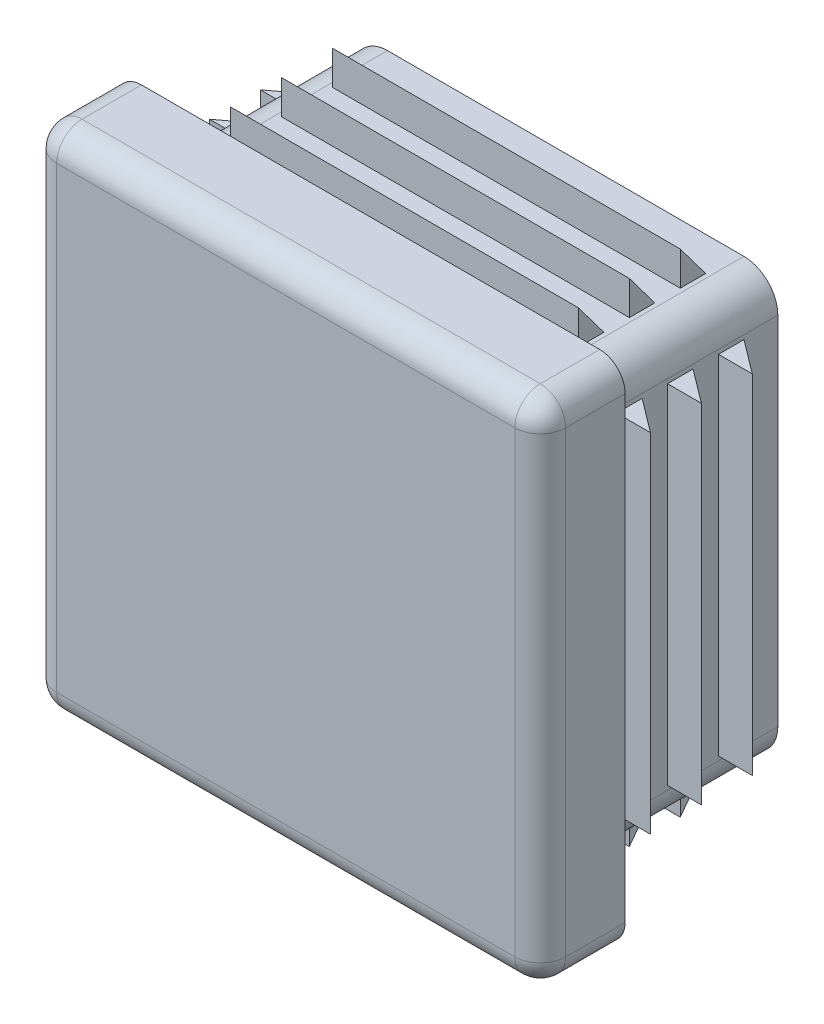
ISO-10303-21;
HEADER;
FILE_DESCRIPTION(('STEP AP214'),'2;1');
FILE_NAME('part.step','',(''),(''),'','','');
FILE_SCHEMA(('AUTOMOTIVE_DESIGN { 1 0 10303 214 1 1 1 1 }'));
ENDSEC;
DATA;
#1=APPLICATION_CONTEXT('core data for automotive mechanical design processes');
#2=APPLICATION_PROTOCOL_DEFINITION('international standard','automotive_design',2000,#1);
#3=PRODUCT_CONTEXT('',#1,'mechanical');
#4=PRODUCT('Part','Part','',(#3));
#5=PRODUCT_RELATED_PRODUCT_CATEGORY('part','',(#4));
#6=PRODUCT_DEFINITION_FORMATION('','',#4);
#7=PRODUCT_DEFINITION_CONTEXT('part definition',#1,'design');
#8=PRODUCT_DEFINITION('design','',#6,#7);
#9=PRODUCT_DEFINITION_SHAPE('','',#8);
#10=(LENGTH_UNIT() NAMED_UNIT(*) SI_UNIT(.MILLI.,.METRE.));
#11=(NAMED_UNIT(*) PLANE_ANGLE_UNIT() SI_UNIT($,.RADIAN.));
#12=(NAMED_UNIT(*) SI_UNIT($,.STERADIAN.) SOLID_ANGLE_UNIT());
#13=UNCERTAINTY_MEASURE_WITH_UNIT(LENGTH_MEASURE(1.E-05),#10,'distance_accuracy_value','');
#14=(GEOMETRIC_REPRESENTATION_CONTEXT(3) GLOBAL_UNCERTAINTY_ASSIGNED_CONTEXT((#13)) GLOBAL_UNIT_ASSIGNED_CONTEXT((#10,
#11,#12)) REPRESENTATION_CONTEXT('',''));
#15=CARTESIAN_POINT('',(0.,0.,0.));
#16=DIRECTION('',(0.,0.,1.));
#17=DIRECTION('',(1.,0.,0.));
#18=AXIS2_PLACEMENT_3D('',#15,#16,#17);
#19=CARTESIAN_POINT('',(0.,0.,11.5));
#20=DIRECTION('',(0.,0.,1.));
#21=DIRECTION('',(1.,0.,0.));
#22=AXIS2_PLACEMENT_3D('',#19,#20,#21);
#23=PLANE('',#22);
#24=CARTESIAN_POINT('',(10.,-10.,11.5));
#25=DIRECTION('',(0.,0.,-1.));
#26=DIRECTION('',(-1.,0.,0.));
#27=AXIS2_PLACEMENT_3D('',#24,#25,#26);
#28=CIRCLE('',#27,1.5);
#29=CARTESIAN_POINT('',(11.5,-10.,11.5));
#30=VERTEX_POINT('',#29);
#31=CARTESIAN_POINT('',(10.,-11.5,11.5));
#32=VERTEX_POINT('',#31);
#33=EDGE_CURVE('E484',#30,#32,#28,.T.);
#34=ORIENTED_EDGE('',*,*,#33,.T.);
#35=DIRECTION('',(1.,0.,0.));
#36=VECTOR('',#35,1.);
#37=CARTESIAN_POINT('',(-11.5,-11.5,11.5));
#38=LINE('',#37,#36);
#39=CARTESIAN_POINT('',(-10.,-11.5,11.5));
#40=VERTEX_POINT('',#39);
#41=EDGE_CURVE('E479',#40,#32,#38,.T.);
#42=ORIENTED_EDGE('',*,*,#41,.F.);
#43=CARTESIAN_POINT('',(-10.,-10.,11.5));
#44=DIRECTION('',(0.,0.,-1.));
#45=DIRECTION('',(-1.,0.,0.));
#46=AXIS2_PLACEMENT_3D('',#43,#44,#45);
#47=CIRCLE('',#46,1.5);
#48=CARTESIAN_POINT('',(-11.5,-10.,11.5));
#49=VERTEX_POINT('',#48);
#50=EDGE_CURVE('E443',#40,#49,#47,.T.);
#51=ORIENTED_EDGE('',*,*,#50,.T.);
#52=DIRECTION('',(0.,1.,0.));
#53=VECTOR('',#52,1.);
#54=CARTESIAN_POINT('',(-11.5,11.5,11.5));
#55=LINE('',#54,#53);
#56=CARTESIAN_POINT('',(-11.5,10.,11.5));
#57=VERTEX_POINT('',#56);
#58=EDGE_CURVE('E439',#57,#49,#55,.F.);
#59=ORIENTED_EDGE('',*,*,#58,.F.);
#60=CARTESIAN_POINT('',(-10.,10.,11.5));
#61=DIRECTION('',(0.,0.,-1.));
#62=DIRECTION('',(-1.,0.,0.));
#63=AXIS2_PLACEMENT_3D('',#60,#61,#62);
#64=CIRCLE('',#63,1.5);
#65=CARTESIAN_POINT('',(-10.,11.5,11.5));
#66=VERTEX_POINT('',#65);
#67=EDGE_CURVE('E18',#57,#66,#64,.T.);
#68=ORIENTED_EDGE('',*,*,#67,.T.);
#69=DIRECTION('',(1.,0.,0.));
#70=VECTOR('',#69,1.);
#71=CARTESIAN_POINT('',(11.5,11.5,11.5));
#72=LINE('',#71,#70);
#73=CARTESIAN_POINT('',(10.,11.5,11.5));
#74=VERTEX_POINT('',#73);
#75=EDGE_CURVE('E458',#74,#66,#72,.F.);
#76=ORIENTED_EDGE('',*,*,#75,.F.);
#77=CARTESIAN_POINT('',(10.,10.,11.5));
#78=DIRECTION('',(0.,0.,-1.));
#79=DIRECTION('',(-1.,0.,0.));
#80=AXIS2_PLACEMENT_3D('',#77,#78,#79);
#81=CIRCLE('',#80,1.5);
#82=CARTESIAN_POINT('',(11.5,10.,11.5));
#83=VERTEX_POINT('',#82);
#84=EDGE_CURVE('E492',#74,#83,#81,.T.);
#85=ORIENTED_EDGE('',*,*,#84,.T.);
#86=DIRECTION('',(0.,1.,0.));
#87=VECTOR('',#86,1.);
#88=CARTESIAN_POINT('',(11.5,-11.5,11.5));
#89=LINE('',#88,#87);
#90=EDGE_CURVE('E488',#30,#83,#89,.T.);
#91=ORIENTED_EDGE('',*,*,#90,.F.);
#92=EDGE_LOOP('',(#34,#42,#51,#59,#68,#76,#85,#91));
#93=FACE_BOUND('',#92,.T.);
#94=ADVANCED_FACE('F15',(#93),#23,.F.);
#95=CARTESIAN_POINT('',(10.25,0.,0.));
#96=DIRECTION('',(-1.,0.,0.));
#97=DIRECTION('',(0.,-1.,0.));
#98=AXIS2_PLACEMENT_3D('',#95,#96,#97);
#99=PLANE('',#98);
#100=DIRECTION('',(0.,-0.8,-0.6));
#101=VECTOR('',#100,1.);
#102=CARTESIAN_POINT('',(10.25,12.5,2.));
#103=LINE('',#102,#101);
#104=CARTESIAN_POINT('',(10.25,12.5,2.));
#105=VERTEX_POINT('',#104);
#106=CARTESIAN_POINT('',(10.25,14.5,3.5));
#107=VERTEX_POINT('',#106);
#108=EDGE_CURVE('E803',#105,#107,#103,.F.);
#109=ORIENTED_EDGE('',*,*,#108,.T.);
#110=DIRECTION('',(0.,1.,0.));
#111=VECTOR('',#110,1.);
#112=CARTESIAN_POINT('',(10.25,14.5,3.5));
#113=LINE('',#112,#111);
#114=CARTESIAN_POINT('',(10.25,12.5,3.5));
#115=VERTEX_POINT('',#114);
#116=EDGE_CURVE('E794',#107,#115,#113,.F.);
#117=ORIENTED_EDGE('',*,*,#116,.T.);
#118=DIRECTION('',(0.,0.,1.));
#119=VECTOR('',#118,1.);
#120=CARTESIAN_POINT('',(10.25,12.5,0.));
#121=LINE('',#120,#119);
#122=EDGE_CURVE('E533',#105,#115,#121,.T.);
#123=ORIENTED_EDGE('',*,*,#122,.F.);
#124=EDGE_LOOP('',(#109,#117,#123));
#125=FACE_BOUND('',#124,.T.);
#126=ADVANCED_FACE('F1271',(#125),#99,.F.);
#127=CARTESIAN_POINT('',(-10.25,0.,0.));
#128=DIRECTION('',(-1.,0.,0.));
#129=DIRECTION('',(0.,-1.,0.));
#130=AXIS2_PLACEMENT_3D('',#127,#128,#129);
#131=PLANE('',#130);
#132=DIRECTION('',(0.,1.,0.));
#133=VECTOR('',#132,1.);
#134=CARTESIAN_POINT('',(-10.25,14.5,3.5));
#135=LINE('',#134,#133);
#136=CARTESIAN_POINT('',(-10.25,12.5,3.5));
#137=VERTEX_POINT('',#136);
#138=CARTESIAN_POINT('',(-10.25,14.5,3.5));
#139=VERTEX_POINT('',#138);
#140=EDGE_CURVE('E791',#137,#139,#135,.T.);
#141=ORIENTED_EDGE('',*,*,#140,.T.);
#142=DIRECTION('',(0.,-0.8,-0.6));
#143=VECTOR('',#142,1.);
#144=CARTESIAN_POINT('',(-10.25,12.5,2.));
#145=LINE('',#144,#143);
#146=CARTESIAN_POINT('',(-10.25,12.5,2.));
#147=VERTEX_POINT('',#146);
#148=EDGE_CURVE('E800',#139,#147,#145,.T.);
#149=ORIENTED_EDGE('',*,*,#148,.T.);
#150=DIRECTION('',(0.,0.,1.));
#151=VECTOR('',#150,1.);
#152=CARTESIAN_POINT('',(-10.25,12.5,0.));
#153=LINE('',#152,#151);
#154=EDGE_CURVE('E531',#147,#137,#153,.T.);
#155=ORIENTED_EDGE('',*,*,#154,.T.);
#156=EDGE_LOOP('',(#141,#149,#155));
#157=FACE_BOUND('',#156,.T.);
#158=ADVANCED_FACE('F1268',(#157),#131,.T.);
#159=CARTESIAN_POINT('',(10.25,0.,0.));
#160=DIRECTION('',(-1.,0.,0.));
#161=DIRECTION('',(0.,-1.,0.));
#162=AXIS2_PLACEMENT_3D('',#159,#160,#161);
#163=PLANE('',#162);
#164=DIRECTION('',(0.,-0.8,-0.6));
#165=VECTOR('',#164,1.);
#166=CARTESIAN_POINT('',(10.25,12.5,5.));
#167=LINE('',#166,#165);
#168=CARTESIAN_POINT('',(10.25,12.5,5.));
#169=VERTEX_POINT('',#168);
#170=CARTESIAN_POINT('',(10.25,14.5,6.5));
#171=VERTEX_POINT('',#170);
#172=EDGE_CURVE('E789',#169,#171,#167,.F.);
#173=ORIENTED_EDGE('',*,*,#172,.T.);
#174=DIRECTION('',(0.,1.,0.));
#175=VECTOR('',#174,1.);
#176=CARTESIAN_POINT('',(10.25,14.5,6.5));
#177=LINE('',#176,#175);
#178=CARTESIAN_POINT('',(10.25,12.5,6.5));
#179=VERTEX_POINT('',#178);
#180=EDGE_CURVE('E780',#171,#179,#177,.F.);
#181=ORIENTED_EDGE('',*,*,#180,.T.);
#182=DIRECTION('',(0.,0.,1.));
#183=VECTOR('',#182,1.);
#184=CARTESIAN_POINT('',(10.25,12.5,0.));
#185=LINE('',#184,#183);
#186=EDGE_CURVE('E529',#169,#179,#185,.T.);
#187=ORIENTED_EDGE('',*,*,#186,.F.);
#188=EDGE_LOOP('',(#173,#181,#187));
#189=FACE_BOUND('',#188,.T.);
#190=ADVANCED_FACE('F1264',(#189),#163,.F.);
#191=CARTESIAN_POINT('',(-10.25,0.,0.));
#192=DIRECTION('',(-1.,0.,0.));
#193=DIRECTION('',(0.,-1.,0.));
#194=AXIS2_PLACEMENT_3D('',#191,#192,#193);
#195=PLANE('',#194);
#196=DIRECTION('',(0.,1.,0.));
#197=VECTOR('',#196,1.);
#198=CARTESIAN_POINT('',(-10.25,14.5,6.5));
#199=LINE('',#198,#197);
#200=CARTESIAN_POINT('',(-10.25,12.5,6.5));
#201=VERTEX_POINT('',#200);
#202=CARTESIAN_POINT('',(-10.25,14.5,6.5));
#203=VERTEX_POINT('',#202);
#204=EDGE_CURVE('E777',#201,#203,#199,.T.);
#205=ORIENTED_EDGE('',*,*,#204,.T.);
#206=DIRECTION('',(0.,-0.8,-0.6));
#207=VECTOR('',#206,1.);
#208=CARTESIAN_POINT('',(-10.25,12.5,5.));
#209=LINE('',#208,#207);
#210=CARTESIAN_POINT('',(-10.25,12.5,5.));
#211=VERTEX_POINT('',#210);
#212=EDGE_CURVE('E786',#203,#211,#209,.T.);
#213=ORIENTED_EDGE('',*,*,#212,.T.);
#214=DIRECTION('',(0.,0.,1.));
#215=VECTOR('',#214,1.);
#216=CARTESIAN_POINT('',(-10.25,12.5,0.));
#217=LINE('',#216,#215);
#218=EDGE_CURVE('E527',#211,#201,#217,.T.);
#219=ORIENTED_EDGE('',*,*,#218,.T.);
#220=EDGE_LOOP('',(#205,#213,#219));
#221=FACE_BOUND('',#220,.T.);
#222=ADVANCED_FACE('F1260',(#221),#195,.T.);
#223=CARTESIAN_POINT('',(10.25,0.,0.));
#224=DIRECTION('',(-1.,0.,0.));
#225=DIRECTION('',(0.,-1.,0.));
#226=AXIS2_PLACEMENT_3D('',#223,#224,#225);
#227=PLANE('',#226);
#228=DIRECTION('',(0.,-0.8,-0.6));
#229=VECTOR('',#228,1.);
#230=CARTESIAN_POINT('',(10.25,12.5,8.));
#231=LINE('',#230,#229);
#232=CARTESIAN_POINT('',(10.25,12.5,8.));
#233=VERTEX_POINT('',#232);
#234=CARTESIAN_POINT('',(10.25,14.5,9.5));
#235=VERTEX_POINT('',#234);
#236=EDGE_CURVE('E775',#233,#235,#231,.F.);
#237=ORIENTED_EDGE('',*,*,#236,.T.);
#238=DIRECTION('',(0.,1.,0.));
#239=VECTOR('',#238,1.);
#240=CARTESIAN_POINT('',(10.25,14.5,9.5));
#241=LINE('',#240,#239);
#242=CARTESIAN_POINT('',(10.25,12.5,9.5));
#243=VERTEX_POINT('',#242);
#244=EDGE_CURVE('E766',#235,#243,#241,.F.);
#245=ORIENTED_EDGE('',*,*,#244,.T.);
#246=DIRECTION('',(0.,0.,1.));
#247=VECTOR('',#246,1.);
#248=CARTESIAN_POINT('',(10.25,12.5,0.));
#249=LINE('',#248,#247);
#250=EDGE_CURVE('E525',#233,#243,#249,.T.);
#251=ORIENTED_EDGE('',*,*,#250,.F.);
#252=EDGE_LOOP('',(#237,#245,#251));
#253=FACE_BOUND('',#252,.T.);
#254=ADVANCED_FACE('F1256',(#253),#227,.F.);
#255=CARTESIAN_POINT('',(-10.25,0.,0.));
#256=DIRECTION('',(-1.,0.,0.));
#257=DIRECTION('',(0.,-1.,0.));
#258=AXIS2_PLACEMENT_3D('',#255,#256,#257);
#259=PLANE('',#258);
#260=DIRECTION('',(0.,1.,0.));
#261=VECTOR('',#260,1.);
#262=CARTESIAN_POINT('',(-10.25,14.5,9.5));
#263=LINE('',#262,#261);
#264=CARTESIAN_POINT('',(-10.25,12.5,9.5));
#265=VERTEX_POINT('',#264);
#266=CARTESIAN_POINT('',(-10.25,14.5,9.5));
#267=VERTEX_POINT('',#266);
#268=EDGE_CURVE('E760',#265,#267,#263,.T.);
#269=ORIENTED_EDGE('',*,*,#268,.T.);
#270=DIRECTION('',(0.,-0.8,-0.6));
#271=VECTOR('',#270,1.);
#272=CARTESIAN_POINT('',(-10.25,12.5,8.));
#273=LINE('',#272,#271);
#274=CARTESIAN_POINT('',(-10.25,12.5,8.));
#275=VERTEX_POINT('',#274);
#276=EDGE_CURVE('E772',#267,#275,#273,.T.);
#277=ORIENTED_EDGE('',*,*,#276,.T.);
#278=DIRECTION('',(0.,0.,1.));
#279=VECTOR('',#278,1.);
#280=CARTESIAN_POINT('',(-10.25,12.5,0.));
#281=LINE('',#280,#279);
#282=EDGE_CURVE('E523',#275,#265,#281,.T.);
#283=ORIENTED_EDGE('',*,*,#282,.T.);
#284=EDGE_LOOP('',(#269,#277,#283));
#285=FACE_BOUND('',#284,.T.);
#286=ADVANCED_FACE('F1252',(#285),#259,.T.);
#287=CARTESIAN_POINT('',(0.,10.25,0.));
#288=DIRECTION('',(0.,1.,0.));
#289=DIRECTION('',(0.,0.,1.));
#290=AXIS2_PLACEMENT_3D('',#287,#288,#289);
#291=PLANE('',#290);
#292=DIRECTION('',(1.,0.,0.));
#293=VECTOR('',#292,1.);
#294=CARTESIAN_POINT('',(12.5,10.25,6.5));
#295=LINE('',#294,#293);
#296=CARTESIAN_POINT('',(14.5,10.25,6.5));
#297=VERTEX_POINT('',#296);
#298=CARTESIAN_POINT('',(12.5,10.25,6.5));
#299=VERTEX_POINT('',#298);
#300=EDGE_CURVE('E750',#297,#299,#295,.F.);
#301=ORIENTED_EDGE('',*,*,#300,.F.);
#302=DIRECTION('',(-0.8,0.,-0.6));
#303=VECTOR('',#302,1.);
#304=CARTESIAN_POINT('',(14.5,10.25,6.5));
#305=LINE('',#304,#303);
#306=CARTESIAN_POINT('',(12.5,10.25,5.));
#307=VERTEX_POINT('',#306);
#308=EDGE_CURVE('E757',#307,#297,#305,.F.);
#309=ORIENTED_EDGE('',*,*,#308,.F.);
#310=DIRECTION('',(0.,0.,1.));
#311=VECTOR('',#310,1.);
#312=CARTESIAN_POINT('',(12.5,10.25,0.));
#313=LINE('',#312,#311);
#314=EDGE_CURVE('E521',#307,#299,#313,.T.);
#315=ORIENTED_EDGE('',*,*,#314,.T.);
#316=EDGE_LOOP('',(#301,#309,#315));
#317=FACE_BOUND('',#316,.T.);
#318=ADVANCED_FACE('F1248',(#317),#291,.T.);
#319=CARTESIAN_POINT('',(0.,-10.25,0.));
#320=DIRECTION('',(0.,1.,0.));
#321=DIRECTION('',(0.,0.,1.));
#322=AXIS2_PLACEMENT_3D('',#319,#320,#321);
#323=PLANE('',#322);
#324=DIRECTION('',(-0.8,0.,-0.6));
#325=VECTOR('',#324,1.);
#326=CARTESIAN_POINT('',(14.5,-10.25,6.5));
#327=LINE('',#326,#325);
#328=CARTESIAN_POINT('',(14.5,-10.25,6.5));
#329=VERTEX_POINT('',#328);
#330=CARTESIAN_POINT('',(12.5,-10.25,5.));
#331=VERTEX_POINT('',#330);
#332=EDGE_CURVE('E753',#329,#331,#327,.T.);
#333=ORIENTED_EDGE('',*,*,#332,.F.);
#334=DIRECTION('',(1.,0.,0.));
#335=VECTOR('',#334,1.);
#336=CARTESIAN_POINT('',(12.5,-10.25,6.5));
#337=LINE('',#336,#335);
#338=CARTESIAN_POINT('',(12.5,-10.25,6.5));
#339=VERTEX_POINT('',#338);
#340=EDGE_CURVE('E746',#339,#329,#337,.T.);
#341=ORIENTED_EDGE('',*,*,#340,.F.);
#342=DIRECTION('',(0.,0.,1.));
#343=VECTOR('',#342,1.);
#344=CARTESIAN_POINT('',(12.5,-10.25,0.));
#345=LINE('',#344,#343);
#346=EDGE_CURVE('E518',#331,#339,#345,.T.);
#347=ORIENTED_EDGE('',*,*,#346,.F.);
#348=EDGE_LOOP('',(#333,#341,#347));
#349=FACE_BOUND('',#348,.T.);
#350=ADVANCED_FACE('F1244',(#349),#323,.F.);
#351=CARTESIAN_POINT('',(0.,10.25,0.));
#352=DIRECTION('',(0.,1.,0.));
#353=DIRECTION('',(0.,0.,1.));
#354=AXIS2_PLACEMENT_3D('',#351,#352,#353);
#355=PLANE('',#354);
#356=DIRECTION('',(1.,0.,0.));
#357=VECTOR('',#356,1.);
#358=CARTESIAN_POINT('',(12.5,10.25,9.5));
#359=LINE('',#358,#357);
#360=CARTESIAN_POINT('',(14.5,10.25,9.5));
#361=VERTEX_POINT('',#360);
#362=CARTESIAN_POINT('',(12.5,10.25,9.5));
#363=VERTEX_POINT('',#362);
#364=EDGE_CURVE('E732',#361,#363,#359,.F.);
#365=ORIENTED_EDGE('',*,*,#364,.F.);
#366=DIRECTION('',(-0.8,0.,-0.6));
#367=VECTOR('',#366,1.);
#368=CARTESIAN_POINT('',(14.5,10.25,9.5));
#369=LINE('',#368,#367);
#370=CARTESIAN_POINT('',(12.5,10.25,8.));
#371=VERTEX_POINT('',#370);
#372=EDGE_CURVE('E739',#371,#361,#369,.F.);
#373=ORIENTED_EDGE('',*,*,#372,.F.);
#374=DIRECTION('',(0.,0.,1.));
#375=VECTOR('',#374,1.);
#376=CARTESIAN_POINT('',(12.5,10.25,0.));
#377=LINE('',#376,#375);
#378=EDGE_CURVE('E516',#371,#363,#377,.T.);
#379=ORIENTED_EDGE('',*,*,#378,.T.);
#380=EDGE_LOOP('',(#365,#373,#379));
#381=FACE_BOUND('',#380,.T.);
#382=ADVANCED_FACE('F1240',(#381),#355,.T.);
#383=CARTESIAN_POINT('',(0.,-10.25,0.));
#384=DIRECTION('',(0.,1.,0.));
#385=DIRECTION('',(0.,0.,1.));
#386=AXIS2_PLACEMENT_3D('',#383,#384,#385);
#387=PLANE('',#386);
#388=DIRECTION('',(-0.8,0.,-0.6));
#389=VECTOR('',#388,1.);
#390=CARTESIAN_POINT('',(14.5,-10.25,9.5));
#391=LINE('',#390,#389);
#392=CARTESIAN_POINT('',(14.5,-10.25,9.5));
#393=VERTEX_POINT('',#392);
#394=CARTESIAN_POINT('',(12.5,-10.25,8.));
#395=VERTEX_POINT('',#394);
#396=EDGE_CURVE('E735',#393,#395,#391,.T.);
#397=ORIENTED_EDGE('',*,*,#396,.F.);
#398=DIRECTION('',(1.,0.,0.));
#399=VECTOR('',#398,1.);
#400=CARTESIAN_POINT('',(12.5,-10.25,9.5));
#401=LINE('',#400,#399);
#402=CARTESIAN_POINT('',(12.5,-10.25,9.5));
#403=VERTEX_POINT('',#402);
#404=EDGE_CURVE('E728',#403,#393,#401,.T.);
#405=ORIENTED_EDGE('',*,*,#404,.F.);
#406=DIRECTION('',(0.,0.,1.));
#407=VECTOR('',#406,1.);
#408=CARTESIAN_POINT('',(12.5,-10.25,0.));
#409=LINE('',#408,#407);
#410=EDGE_CURVE('E513',#395,#403,#409,.T.);
#411=ORIENTED_EDGE('',*,*,#410,.F.);
#412=EDGE_LOOP('',(#397,#405,#411));
#413=FACE_BOUND('',#412,.T.);
#414=ADVANCED_FACE('F1236',(#413),#387,.F.);
#415=CARTESIAN_POINT('',(0.,10.25,0.));
#416=DIRECTION('',(0.,1.,0.));
#417=DIRECTION('',(0.,0.,1.));
#418=AXIS2_PLACEMENT_3D('',#415,#416,#417);
#419=PLANE('',#418);
#420=DIRECTION('',(1.,0.,0.));
#421=VECTOR('',#420,1.);
#422=CARTESIAN_POINT('',(12.5,10.25,3.5));
#423=LINE('',#422,#421);
#424=CARTESIAN_POINT('',(14.5,10.25,3.5));
#425=VERTEX_POINT('',#424);
#426=CARTESIAN_POINT('',(12.5,10.25,3.5));
#427=VERTEX_POINT('',#426);
#428=EDGE_CURVE('E714',#425,#427,#423,.F.);
#429=ORIENTED_EDGE('',*,*,#428,.F.);
#430=DIRECTION('',(-0.8,0.,-0.6));
#431=VECTOR('',#430,1.);
#432=CARTESIAN_POINT('',(14.5,10.25,3.5));
#433=LINE('',#432,#431);
#434=CARTESIAN_POINT('',(12.5,10.25,2.));
#435=VERTEX_POINT('',#434);
#436=EDGE_CURVE('E721',#435,#425,#433,.F.);
#437=ORIENTED_EDGE('',*,*,#436,.F.);
#438=DIRECTION('',(0.,0.,1.));
#439=VECTOR('',#438,1.);
#440=CARTESIAN_POINT('',(12.5,10.25,0.));
#441=LINE('',#440,#439);
#442=EDGE_CURVE('E511',#435,#427,#441,.T.);
#443=ORIENTED_EDGE('',*,*,#442,.T.);
#444=EDGE_LOOP('',(#429,#437,#443));
#445=FACE_BOUND('',#444,.T.);
#446=ADVANCED_FACE('F1232',(#445),#419,.T.);
#447=CARTESIAN_POINT('',(0.,-10.25,0.));
#448=DIRECTION('',(0.,1.,0.));
#449=DIRECTION('',(0.,0.,1.));
#450=AXIS2_PLACEMENT_3D('',#447,#448,#449);
#451=PLANE('',#450);
#452=DIRECTION('',(-0.8,0.,-0.6));
#453=VECTOR('',#452,1.);
#454=CARTESIAN_POINT('',(14.5,-10.25,3.5));
#455=LINE('',#454,#453);
#456=CARTESIAN_POINT('',(14.5,-10.25,3.5));
#457=VERTEX_POINT('',#456);
#458=CARTESIAN_POINT('',(12.5,-10.25,2.));
#459=VERTEX_POINT('',#458);
#460=EDGE_CURVE('E717',#457,#459,#455,.T.);
#461=ORIENTED_EDGE('',*,*,#460,.F.);
#462=DIRECTION('',(1.,0.,0.));
#463=VECTOR('',#462,1.);
#464=CARTESIAN_POINT('',(12.5,-10.25,3.5));
#465=LINE('',#464,#463);
#466=CARTESIAN_POINT('',(12.5,-10.25,3.5));
#467=VERTEX_POINT('',#466);
#468=EDGE_CURVE('E710',#467,#457,#465,.T.);
#469=ORIENTED_EDGE('',*,*,#468,.F.);
#470=DIRECTION('',(0.,0.,1.));
#471=VECTOR('',#470,1.);
#472=CARTESIAN_POINT('',(12.5,-10.25,0.));
#473=LINE('',#472,#471);
#474=EDGE_CURVE('E508',#459,#467,#473,.T.);
#475=ORIENTED_EDGE('',*,*,#474,.F.);
#476=EDGE_LOOP('',(#461,#469,#475));
#477=FACE_BOUND('',#476,.T.);
#478=ADVANCED_FACE('F1228',(#477),#451,.F.);
#479=CARTESIAN_POINT('',(-10.25,0.,0.));
#480=DIRECTION('',(1.,0.,0.));
#481=DIRECTION('',(0.,1.,0.));
#482=AXIS2_PLACEMENT_3D('',#479,#480,#481);
#483=PLANE('',#482);
#484=DIRECTION('',(0.,0.8,-0.6));
#485=VECTOR('',#484,1.);
#486=CARTESIAN_POINT('',(-10.25,-12.5,2.));
#487=LINE('',#486,#485);
#488=CARTESIAN_POINT('',(-10.25,-14.5,3.5));
#489=VERTEX_POINT('',#488);
#490=CARTESIAN_POINT('',(-10.25,-12.5,2.));
#491=VERTEX_POINT('',#490);
#492=EDGE_CURVE('E698',#489,#491,#487,.T.);
#493=ORIENTED_EDGE('',*,*,#492,.F.);
#494=DIRECTION('',(0.,1.,0.));
#495=VECTOR('',#494,1.);
#496=CARTESIAN_POINT('',(-10.25,-14.5,3.5));
#497=LINE('',#496,#495);
#498=CARTESIAN_POINT('',(-10.25,-12.5,3.5));
#499=VERTEX_POINT('',#498);
#500=EDGE_CURVE('E692',#499,#489,#497,.F.);
#501=ORIENTED_EDGE('',*,*,#500,.F.);
#502=DIRECTION('',(0.,0.,1.));
#503=VECTOR('',#502,1.);
#504=CARTESIAN_POINT('',(-10.25,-12.5,0.));
#505=LINE('',#504,#503);
#506=EDGE_CURVE('E506',#491,#499,#505,.T.);
#507=ORIENTED_EDGE('',*,*,#506,.F.);
#508=EDGE_LOOP('',(#493,#501,#507));
#509=FACE_BOUND('',#508,.T.);
#510=ADVANCED_FACE('F1224',(#509),#483,.F.);
#511=CARTESIAN_POINT('',(10.25,0.,0.));
#512=DIRECTION('',(1.,0.,0.));
#513=DIRECTION('',(0.,1.,0.));
#514=AXIS2_PLACEMENT_3D('',#511,#512,#513);
#515=PLANE('',#514);
#516=DIRECTION('',(0.,1.,0.));
#517=VECTOR('',#516,1.);
#518=CARTESIAN_POINT('',(10.25,-14.5,3.5));
#519=LINE('',#518,#517);
#520=CARTESIAN_POINT('',(10.25,-14.5,3.5));
#521=VERTEX_POINT('',#520);
#522=CARTESIAN_POINT('',(10.25,-12.5,3.5));
#523=VERTEX_POINT('',#522);
#524=EDGE_CURVE('E684',#521,#523,#519,.T.);
#525=ORIENTED_EDGE('',*,*,#524,.F.);
#526=DIRECTION('',(0.,0.8,-0.6));
#527=VECTOR('',#526,1.);
#528=CARTESIAN_POINT('',(10.25,-12.5,2.));
#529=LINE('',#528,#527);
#530=CARTESIAN_POINT('',(10.25,-12.5,1.99999999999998));
#531=VERTEX_POINT('',#530);
#532=EDGE_CURVE('E695',#531,#521,#529,.F.);
#533=ORIENTED_EDGE('',*,*,#532,.F.);
#534=DIRECTION('',(0.,0.,1.));
#535=VECTOR('',#534,1.);
#536=CARTESIAN_POINT('',(10.25,-12.5,0.));
#537=LINE('',#536,#535);
#538=EDGE_CURVE('E503',#531,#523,#537,.T.);
#539=ORIENTED_EDGE('',*,*,#538,.T.);
#540=EDGE_LOOP('',(#525,#533,#539));
#541=FACE_BOUND('',#540,.T.);
#542=ADVANCED_FACE('F1220',(#541),#515,.T.);
#543=CARTESIAN_POINT('',(-10.25,0.,0.));
#544=DIRECTION('',(1.,0.,0.));
#545=DIRECTION('',(0.,1.,0.));
#546=AXIS2_PLACEMENT_3D('',#543,#544,#545);
#547=PLANE('',#546);
#548=DIRECTION('',(0.,0.8,-0.6));
#549=VECTOR('',#548,1.);
#550=CARTESIAN_POINT('',(-10.25,-12.5,5.));
#551=LINE('',#550,#549);
#552=CARTESIAN_POINT('',(-10.25,-14.5,6.5));
#553=VERTEX_POINT('',#552);
#554=CARTESIAN_POINT('',(-10.25,-12.5,5.));
#555=VERTEX_POINT('',#554);
#556=EDGE_CURVE('E681',#553,#555,#551,.T.);
#557=ORIENTED_EDGE('',*,*,#556,.F.);
#558=DIRECTION('',(0.,1.,0.));
#559=VECTOR('',#558,1.);
#560=CARTESIAN_POINT('',(-10.25,-14.5,6.5));
#561=LINE('',#560,#559);
#562=CARTESIAN_POINT('',(-10.25,-12.5,6.5));
#563=VERTEX_POINT('',#562);
#564=EDGE_CURVE('E675',#563,#553,#561,.F.);
#565=ORIENTED_EDGE('',*,*,#564,.F.);
#566=DIRECTION('',(0.,0.,1.));
#567=VECTOR('',#566,1.);
#568=CARTESIAN_POINT('',(-10.25,-12.5,0.));
#569=LINE('',#568,#567);
#570=EDGE_CURVE('E501',#555,#563,#569,.T.);
#571=ORIENTED_EDGE('',*,*,#570,.F.);
#572=EDGE_LOOP('',(#557,#565,#571));
#573=FACE_BOUND('',#572,.T.);
#574=ADVANCED_FACE('F1216',(#573),#547,.F.);
#575=CARTESIAN_POINT('',(10.25,0.,0.));
#576=DIRECTION('',(1.,0.,0.));
#577=DIRECTION('',(0.,1.,0.));
#578=AXIS2_PLACEMENT_3D('',#575,#576,#577);
#579=PLANE('',#578);
#580=DIRECTION('',(0.,1.,0.));
#581=VECTOR('',#580,1.);
#582=CARTESIAN_POINT('',(10.25,-14.5,6.5));
#583=LINE('',#582,#581);
#584=CARTESIAN_POINT('',(10.25,-14.5,6.5));
#585=VERTEX_POINT('',#584);
#586=CARTESIAN_POINT('',(10.25,-12.5,6.5));
#587=VERTEX_POINT('',#586);
#588=EDGE_CURVE('E667',#585,#587,#583,.T.);
#589=ORIENTED_EDGE('',*,*,#588,.F.);
#590=DIRECTION('',(0.,0.8,-0.6));
#591=VECTOR('',#590,1.);
#592=CARTESIAN_POINT('',(10.25,-12.5,5.));
#593=LINE('',#592,#591);
#594=CARTESIAN_POINT('',(10.25,-12.5,5.));
#595=VERTEX_POINT('',#594);
#596=EDGE_CURVE('E678',#595,#585,#593,.F.);
#597=ORIENTED_EDGE('',*,*,#596,.F.);
#598=DIRECTION('',(0.,0.,1.));
#599=VECTOR('',#598,1.);
#600=CARTESIAN_POINT('',(10.25,-12.5,0.));
#601=LINE('',#600,#599);
#602=EDGE_CURVE('E498',#595,#587,#601,.T.);
#603=ORIENTED_EDGE('',*,*,#602,.T.);
#604=EDGE_LOOP('',(#589,#597,#603));
#605=FACE_BOUND('',#604,.T.);
#606=ADVANCED_FACE('F1212',(#605),#579,.T.);
#607=CARTESIAN_POINT('',(-10.25,0.,0.));
#608=DIRECTION('',(1.,0.,0.));
#609=DIRECTION('',(0.,1.,0.));
#610=AXIS2_PLACEMENT_3D('',#607,#608,#609);
#611=PLANE('',#610);
#612=DIRECTION('',(0.,0.8,-0.6));
#613=VECTOR('',#612,1.);
#614=CARTESIAN_POINT('',(-10.25,-12.5,8.));
#615=LINE('',#614,#613);
#616=CARTESIAN_POINT('',(-10.25,-14.5,9.5));
#617=VERTEX_POINT('',#616);
#618=CARTESIAN_POINT('',(-10.25,-12.5,8.));
#619=VERTEX_POINT('',#618);
#620=EDGE_CURVE('E664',#617,#619,#615,.T.);
#621=ORIENTED_EDGE('',*,*,#620,.F.);
#622=DIRECTION('',(0.,1.,0.));
#623=VECTOR('',#622,1.);
#624=CARTESIAN_POINT('',(-10.25,-14.5,9.5));
#625=LINE('',#624,#623);
#626=CARTESIAN_POINT('',(-10.25,-12.5,9.5));
#627=VERTEX_POINT('',#626);
#628=EDGE_CURVE('E658',#627,#617,#625,.F.);
#629=ORIENTED_EDGE('',*,*,#628,.F.);
#630=DIRECTION('',(0.,0.,1.));
#631=VECTOR('',#630,1.);
#632=CARTESIAN_POINT('',(-10.25,-12.5,0.));
#633=LINE('',#632,#631);
#634=EDGE_CURVE('E496',#619,#627,#633,.T.);
#635=ORIENTED_EDGE('',*,*,#634,.F.);
#636=EDGE_LOOP('',(#621,#629,#635));
#637=FACE_BOUND('',#636,.T.);
#638=ADVANCED_FACE('F1208',(#637),#611,.F.);
#639=CARTESIAN_POINT('',(10.25,0.,0.));
#640=DIRECTION('',(1.,0.,0.));
#641=DIRECTION('',(0.,1.,0.));
#642=AXIS2_PLACEMENT_3D('',#639,#640,#641);
#643=PLANE('',#642);
#644=DIRECTION('',(0.,1.,0.));
#645=VECTOR('',#644,1.);
#646=CARTESIAN_POINT('',(10.25,-14.5,9.5));
#647=LINE('',#646,#645);
#648=CARTESIAN_POINT('',(10.25,-14.5,9.5));
#649=VERTEX_POINT('',#648);
#650=CARTESIAN_POINT('',(10.25,-12.5,9.5));
#651=VERTEX_POINT('',#650);
#652=EDGE_CURVE('E599',#649,#651,#647,.T.);
#653=ORIENTED_EDGE('',*,*,#652,.F.);
#654=DIRECTION('',(0.,0.8,-0.6));
#655=VECTOR('',#654,1.);
#656=CARTESIAN_POINT('',(10.25,-12.5,8.));
#657=LINE('',#656,#655);
#658=CARTESIAN_POINT('',(10.25,-12.5,8.));
#659=VERTEX_POINT('',#658);
#660=EDGE_CURVE('E661',#659,#649,#657,.F.);
#661=ORIENTED_EDGE('',*,*,#660,.F.);
#662=DIRECTION('',(0.,0.,1.));
#663=VECTOR('',#662,1.);
#664=CARTESIAN_POINT('',(10.25,-12.5,0.));
#665=LINE('',#664,#663);
#666=EDGE_CURVE('E459',#659,#651,#665,.T.);
#667=ORIENTED_EDGE('',*,*,#666,.T.);
#668=EDGE_LOOP('',(#653,#661,#667));
#669=FACE_BOUND('',#668,.T.);
#670=ADVANCED_FACE('F1205',(#669),#643,.T.);
#671=CARTESIAN_POINT('',(-10.,10.,11.5));
#672=DIRECTION('',(0.,0.,-1.));
#673=DIRECTION('',(-1.,0.,0.));
#674=AXIS2_PLACEMENT_3D('',#671,#672,#673);
#675=CYLINDRICAL_SURFACE('',#674,1.5);
#676=DIRECTION('',(0.,0.,-1.));
#677=VECTOR('',#676,1.);
#678=CARTESIAN_POINT('',(-11.5,10.,11.5));
#679=LINE('',#678,#677);
#680=CARTESIAN_POINT('',(-11.5,10.,0.));
#681=VERTEX_POINT('',#680);
#682=EDGE_CURVE('E453',#681,#57,#679,.F.);
#683=ORIENTED_EDGE('',*,*,#682,.F.);
#684=CARTESIAN_POINT('',(-10.,10.,0.));
#685=DIRECTION('',(0.,0.,-1.));
#686=DIRECTION('',(-1.,0.,0.));
#687=AXIS2_PLACEMENT_3D('',#684,#685,#686);
#688=CIRCLE('',#687,1.5);
#689=CARTESIAN_POINT('',(-10.,11.5,0.));
#690=VERTEX_POINT('',#689);
#691=EDGE_CURVE('E597',#681,#690,#688,.T.);
#692=ORIENTED_EDGE('',*,*,#691,.T.);
#693=DIRECTION('',(0.,0.,1.));
#694=VECTOR('',#693,1.);
#695=CARTESIAN_POINT('',(-10.,11.5,11.5));
#696=LINE('',#695,#694);
#697=EDGE_CURVE('E456',#66,#690,#696,.F.);
#698=ORIENTED_EDGE('',*,*,#697,.F.);
#699=ORIENTED_EDGE('',*,*,#67,.F.);
#700=EDGE_LOOP('',(#683,#692,#698,#699));
#701=FACE_BOUND('',#700,.T.);
#702=ADVANCED_FACE('F452',(#701),#675,.F.);
#703=CARTESIAN_POINT('',(11.5,11.5,11.5));
#704=DIRECTION('',(0.,-1.,0.));
#705=DIRECTION('',(1.,0.,0.));
#706=AXIS2_PLACEMENT_3D('',#703,#704,#705);
#707=PLANE('',#706);
#708=DIRECTION('',(1.,0.,0.));
#709=VECTOR('',#708,1.);
#710=CARTESIAN_POINT('',(0.,11.5,0.));
#711=LINE('',#710,#709);
#712=CARTESIAN_POINT('',(10.,11.5,0.));
#713=VERTEX_POINT('',#712);
#714=EDGE_CURVE('E596',#690,#713,#711,.T.);
#715=ORIENTED_EDGE('',*,*,#714,.T.);
#716=DIRECTION('',(0.,0.,-1.));
#717=VECTOR('',#716,1.);
#718=CARTESIAN_POINT('',(10.,11.5,11.5));
#719=LINE('',#718,#717);
#720=EDGE_CURVE('E489',#713,#74,#719,.F.);
#721=ORIENTED_EDGE('',*,*,#720,.T.);
#722=ORIENTED_EDGE('',*,*,#75,.T.);
#723=ORIENTED_EDGE('',*,*,#697,.T.);
#724=EDGE_LOOP('',(#715,#721,#722,#723));
#725=FACE_BOUND('',#724,.T.);
#726=ADVANCED_FACE('F1199',(#725),#707,.T.);
#727=CARTESIAN_POINT('',(10.,10.,11.5));
#728=DIRECTION('',(0.,0.,-1.));
#729=DIRECTION('',(-1.,0.,0.));
#730=AXIS2_PLACEMENT_3D('',#727,#728,#729);
#731=CYLINDRICAL_SURFACE('',#730,1.5);
#732=ORIENTED_EDGE('',*,*,#720,.F.);
#733=CARTESIAN_POINT('',(10.,10.,0.));
#734=DIRECTION('',(0.,0.,-1.));
#735=DIRECTION('',(-1.,0.,0.));
#736=AXIS2_PLACEMENT_3D('',#733,#734,#735);
#737=CIRCLE('',#736,1.5);
#738=CARTESIAN_POINT('',(11.5,10.,0.));
#739=VERTEX_POINT('',#738);
#740=EDGE_CURVE('E594',#713,#739,#737,.T.);
#741=ORIENTED_EDGE('',*,*,#740,.T.);
#742=DIRECTION('',(0.,0.,1.));
#743=VECTOR('',#742,1.);
#744=CARTESIAN_POINT('',(11.5,10.,11.5));
#745=LINE('',#744,#743);
#746=EDGE_CURVE('E485',#83,#739,#745,.F.);
#747=ORIENTED_EDGE('',*,*,#746,.F.);
#748=ORIENTED_EDGE('',*,*,#84,.F.);
#749=EDGE_LOOP('',(#732,#741,#747,#748));
#750=FACE_BOUND('',#749,.T.);
#751=ADVANCED_FACE('F607',(#750),#731,.F.);
#752=CARTESIAN_POINT('',(11.5,-11.5,11.5));
#753=DIRECTION('',(-1.,0.,0.));
#754=DIRECTION('',(0.,0.,1.));
#755=AXIS2_PLACEMENT_3D('',#752,#753,#754);
#756=PLANE('',#755);
#757=ORIENTED_EDGE('',*,*,#90,.T.);
#758=ORIENTED_EDGE('',*,*,#746,.T.);
#759=DIRECTION('',(0.,1.,0.));
#760=VECTOR('',#759,1.);
#761=CARTESIAN_POINT('',(11.5,0.,0.));
#762=LINE('',#761,#760);
#763=CARTESIAN_POINT('',(11.5,-10.,0.));
#764=VERTEX_POINT('',#763);
#765=EDGE_CURVE('E593',#739,#764,#762,.F.);
#766=ORIENTED_EDGE('',*,*,#765,.T.);
#767=DIRECTION('',(0.,0.,-1.));
#768=VECTOR('',#767,1.);
#769=CARTESIAN_POINT('',(11.5,-10.,11.5));
#770=LINE('',#769,#768);
#771=EDGE_CURVE('E480',#764,#30,#770,.F.);
#772=ORIENTED_EDGE('',*,*,#771,.T.);
#773=EDGE_LOOP('',(#757,#758,#766,#772));
#774=FACE_BOUND('',#773,.T.);
#775=ADVANCED_FACE('F611',(#774),#756,.T.);
#776=CARTESIAN_POINT('',(10.,-10.,11.5));
#777=DIRECTION('',(0.,0.,-1.));
#778=DIRECTION('',(-1.,0.,0.));
#779=AXIS2_PLACEMENT_3D('',#776,#777,#778);
#780=CYLINDRICAL_SURFACE('',#779,1.5);
#781=ORIENTED_EDGE('',*,*,#771,.F.);
#782=CARTESIAN_POINT('',(10.,-10.,0.));
#783=DIRECTION('',(0.,0.,-1.));
#784=DIRECTION('',(-1.,0.,0.));
#785=AXIS2_PLACEMENT_3D('',#782,#783,#784);
#786=CIRCLE('',#785,1.5);
#787=CARTESIAN_POINT('',(10.,-11.5,0.));
#788=VERTEX_POINT('',#787);
#789=EDGE_CURVE('E590',#764,#788,#786,.T.);
#790=ORIENTED_EDGE('',*,*,#789,.T.);
#791=DIRECTION('',(0.,0.,1.));
#792=VECTOR('',#791,1.);
#793=CARTESIAN_POINT('',(10.,-11.5,11.5));
#794=LINE('',#793,#792);
#795=EDGE_CURVE('E475',#32,#788,#794,.F.);
#796=ORIENTED_EDGE('',*,*,#795,.F.);
#797=ORIENTED_EDGE('',*,*,#33,.F.);
#798=EDGE_LOOP('',(#781,#790,#796,#797));
#799=FACE_BOUND('',#798,.T.);
#800=ADVANCED_FACE('F617',(#799),#780,.F.);
#801=CARTESIAN_POINT('',(-11.5,-11.5,11.5));
#802=DIRECTION('',(0.,1.,0.));
#803=DIRECTION('',(0.,0.,1.));
#804=AXIS2_PLACEMENT_3D('',#801,#802,#803);
#805=PLANE('',#804);
#806=DIRECTION('',(1.,0.,0.));
#807=VECTOR('',#806,1.);
#808=CARTESIAN_POINT('',(0.,-11.5,0.));
#809=LINE('',#808,#807);
#810=CARTESIAN_POINT('',(-10.,-11.5,0.));
#811=VERTEX_POINT('',#810);
#812=EDGE_CURVE('E589',#788,#811,#809,.F.);
#813=ORIENTED_EDGE('',*,*,#812,.T.);
#814=DIRECTION('',(0.,0.,-1.));
#815=VECTOR('',#814,1.);
#816=CARTESIAN_POINT('',(-10.,-11.5,11.5));
#817=LINE('',#816,#815);
#818=EDGE_CURVE('E471',#811,#40,#817,.F.);
#819=ORIENTED_EDGE('',*,*,#818,.T.);
#820=ORIENTED_EDGE('',*,*,#41,.T.);
#821=ORIENTED_EDGE('',*,*,#795,.T.);
#822=EDGE_LOOP('',(#813,#819,#820,#821));
#823=FACE_BOUND('',#822,.T.);
#824=ADVANCED_FACE('F620',(#823),#805,.T.);
#825=CARTESIAN_POINT('',(-10.,-10.,11.5));
#826=DIRECTION('',(0.,0.,-1.));
#827=DIRECTION('',(-1.,0.,0.));
#828=AXIS2_PLACEMENT_3D('',#825,#826,#827);
#829=CYLINDRICAL_SURFACE('',#828,1.5);
#830=ORIENTED_EDGE('',*,*,#818,.F.);
#831=CARTESIAN_POINT('',(-10.,-10.,0.));
#832=DIRECTION('',(0.,0.,-1.));
#833=DIRECTION('',(-1.,0.,0.));
#834=AXIS2_PLACEMENT_3D('',#831,#832,#833);
#835=CIRCLE('',#834,1.5);
#836=CARTESIAN_POINT('',(-11.5,-10.,0.));
#837=VERTEX_POINT('',#836);
#838=EDGE_CURVE('E587',#811,#837,#835,.T.);
#839=ORIENTED_EDGE('',*,*,#838,.T.);
#840=DIRECTION('',(0.,0.,-1.));
#841=VECTOR('',#840,1.);
#842=CARTESIAN_POINT('',(-11.5,-10.,11.5));
#843=LINE('',#842,#841);
#844=EDGE_CURVE('E449',#49,#837,#843,.T.);
#845=ORIENTED_EDGE('',*,*,#844,.F.);
#846=ORIENTED_EDGE('',*,*,#50,.F.);
#847=EDGE_LOOP('',(#830,#839,#845,#846));
#848=FACE_BOUND('',#847,.T.);
#849=ADVANCED_FACE('F624',(#848),#829,.F.);
#850=CARTESIAN_POINT('',(-11.5,11.5,11.5));
#851=DIRECTION('',(1.,0.,0.));
#852=DIRECTION('',(0.,0.,-1.));
#853=AXIS2_PLACEMENT_3D('',#850,#851,#852);
#854=PLANE('',#853);
#855=DIRECTION('',(0.,1.,0.));
#856=VECTOR('',#855,1.);
#857=CARTESIAN_POINT('',(-11.5,0.,0.));
#858=LINE('',#857,#856);
#859=EDGE_CURVE('E462',#837,#681,#858,.T.);
#860=ORIENTED_EDGE('',*,*,#859,.T.);
#861=ORIENTED_EDGE('',*,*,#682,.T.);
#862=ORIENTED_EDGE('',*,*,#58,.T.);
#863=ORIENTED_EDGE('',*,*,#844,.T.);
#864=EDGE_LOOP('',(#860,#861,#862,#863));
#865=FACE_BOUND('',#864,.T.);
#866=ADVANCED_FACE('F460',(#865),#854,.T.);
#867=CARTESIAN_POINT('',(0.,-10.25,0.));
#868=DIRECTION('',(0.,-1.,0.));
#869=DIRECTION('',(0.,0.,-1.));
#870=AXIS2_PLACEMENT_3D('',#867,#868,#869);
#871=PLANE('',#870);
#872=DIRECTION('',(-1.,0.,0.));
#873=VECTOR('',#872,1.);
#874=CARTESIAN_POINT('',(-12.5,-10.25,3.5));
#875=LINE('',#874,#873);
#876=CARTESIAN_POINT('',(-12.5,-10.25,3.5));
#877=VERTEX_POINT('',#876);
#878=CARTESIAN_POINT('',(-14.5,-10.25,3.5));
#879=VERTEX_POINT('',#878);
#880=EDGE_CURVE('E835',#877,#879,#875,.T.);
#881=ORIENTED_EDGE('',*,*,#880,.T.);
#882=DIRECTION('',(0.8,0.,-0.6));
#883=VECTOR('',#882,1.);
#884=CARTESIAN_POINT('',(-14.5,-10.25,3.5));
#885=LINE('',#884,#883);
#886=CARTESIAN_POINT('',(-12.5,-10.25,2.));
#887=VERTEX_POINT('',#886);
#888=EDGE_CURVE('E629',#879,#887,#885,.T.);
#889=ORIENTED_EDGE('',*,*,#888,.T.);
#890=DIRECTION('',(0.,0.,-1.));
#891=VECTOR('',#890,1.);
#892=CARTESIAN_POINT('',(-12.5,-10.25,0.));
#893=LINE('',#892,#891);
#894=EDGE_CURVE('E464',#887,#877,#893,.F.);
#895=ORIENTED_EDGE('',*,*,#894,.T.);
#896=EDGE_LOOP('',(#881,#889,#895));
#897=FACE_BOUND('',#896,.T.);
#898=ADVANCED_FACE('F950',(#897),#871,.T.);
#899=CARTESIAN_POINT('',(0.,10.25,0.));
#900=DIRECTION('',(0.,-1.,0.));
#901=DIRECTION('',(0.,0.,-1.));
#902=AXIS2_PLACEMENT_3D('',#899,#900,#901);
#903=PLANE('',#902);
#904=DIRECTION('',(0.8,0.,-0.6));
#905=VECTOR('',#904,1.);
#906=CARTESIAN_POINT('',(-14.5,10.25,3.5));
#907=LINE('',#906,#905);
#908=CARTESIAN_POINT('',(-12.5,10.25,2.));
#909=VERTEX_POINT('',#908);
#910=CARTESIAN_POINT('',(-14.5,10.25,3.5));
#911=VERTEX_POINT('',#910);
#912=EDGE_CURVE('E632',#909,#911,#907,.F.);
#913=ORIENTED_EDGE('',*,*,#912,.T.);
#914=DIRECTION('',(-1.,0.,0.));
#915=VECTOR('',#914,1.);
#916=CARTESIAN_POINT('',(-12.5,10.25,3.5));
#917=LINE('',#916,#915);
#918=CARTESIAN_POINT('',(-12.5,10.25,3.5));
#919=VERTEX_POINT('',#918);
#920=EDGE_CURVE('E825',#911,#919,#917,.F.);
#921=ORIENTED_EDGE('',*,*,#920,.T.);
#922=DIRECTION('',(0.,0.,-1.));
#923=VECTOR('',#922,1.);
#924=CARTESIAN_POINT('',(-12.5,10.25,0.));
#925=LINE('',#924,#923);
#926=EDGE_CURVE('E466',#909,#919,#925,.F.);
#927=ORIENTED_EDGE('',*,*,#926,.F.);
#928=EDGE_LOOP('',(#913,#921,#927));
#929=FACE_BOUND('',#928,.T.);
#930=ADVANCED_FACE('F826',(#929),#903,.F.);
#931=CARTESIAN_POINT('',(0.,-10.25,0.));
#932=DIRECTION('',(0.,-1.,0.));
#933=DIRECTION('',(0.,0.,-1.));
#934=AXIS2_PLACEMENT_3D('',#931,#932,#933);
#935=PLANE('',#934);
#936=DIRECTION('',(-1.,0.,0.));
#937=VECTOR('',#936,1.);
#938=CARTESIAN_POINT('',(-12.5,-10.25,6.5));
#939=LINE('',#938,#937);
#940=CARTESIAN_POINT('',(-12.5,-10.25,6.5));
#941=VERTEX_POINT('',#940);
#942=CARTESIAN_POINT('',(-14.5,-10.25,6.5));
#943=VERTEX_POINT('',#942);
#944=EDGE_CURVE('E941',#941,#943,#939,.T.);
#945=ORIENTED_EDGE('',*,*,#944,.T.);
#946=DIRECTION('',(0.8,0.,-0.6));
#947=VECTOR('',#946,1.);
#948=CARTESIAN_POINT('',(-14.5,-10.25,6.5));
#949=LINE('',#948,#947);
#950=CARTESIAN_POINT('',(-12.5,-10.25,5.));
#951=VERTEX_POINT('',#950);
#952=EDGE_CURVE('E830',#943,#951,#949,.T.);
#953=ORIENTED_EDGE('',*,*,#952,.T.);
#954=DIRECTION('',(0.,0.,-1.));
#955=VECTOR('',#954,1.);
#956=CARTESIAN_POINT('',(-12.5,-10.25,0.));
#957=LINE('',#956,#955);
#958=EDGE_CURVE('E811',#951,#941,#957,.F.);
#959=ORIENTED_EDGE('',*,*,#958,.T.);
#960=EDGE_LOOP('',(#945,#953,#959));
#961=FACE_BOUND('',#960,.T.);
#962=ADVANCED_FACE('F1173',(#961),#935,.T.);
#963=CARTESIAN_POINT('',(0.,10.25,0.));
#964=DIRECTION('',(0.,-1.,0.));
#965=DIRECTION('',(0.,0.,-1.));
#966=AXIS2_PLACEMENT_3D('',#963,#964,#965);
#967=PLANE('',#966);
#968=DIRECTION('',(0.8,0.,-0.6));
#969=VECTOR('',#968,1.);
#970=CARTESIAN_POINT('',(-14.5,10.25,6.5));
#971=LINE('',#970,#969);
#972=CARTESIAN_POINT('',(-12.5,10.25,5.));
#973=VERTEX_POINT('',#972);
#974=CARTESIAN_POINT('',(-14.5,10.25,6.5));
#975=VERTEX_POINT('',#974);
#976=EDGE_CURVE('E943',#973,#975,#971,.F.);
#977=ORIENTED_EDGE('',*,*,#976,.T.);
#978=DIRECTION('',(-1.,0.,0.));
#979=VECTOR('',#978,1.);
#980=CARTESIAN_POINT('',(-12.5,10.25,6.5));
#981=LINE('',#980,#979);
#982=CARTESIAN_POINT('',(-12.5,10.25,6.5));
#983=VERTEX_POINT('',#982);
#984=EDGE_CURVE('E935',#975,#983,#981,.F.);
#985=ORIENTED_EDGE('',*,*,#984,.T.);
#986=DIRECTION('',(0.,0.,-1.));
#987=VECTOR('',#986,1.);
#988=CARTESIAN_POINT('',(-12.5,10.25,0.));
#989=LINE('',#988,#987);
#990=EDGE_CURVE('E809',#973,#983,#989,.F.);
#991=ORIENTED_EDGE('',*,*,#990,.F.);
#992=EDGE_LOOP('',(#977,#985,#991));
#993=FACE_BOUND('',#992,.T.);
#994=ADVANCED_FACE('F1169',(#993),#967,.F.);
#995=CARTESIAN_POINT('',(0.,-10.25,0.));
#996=DIRECTION('',(0.,-1.,0.));
#997=DIRECTION('',(0.,0.,-1.));
#998=AXIS2_PLACEMENT_3D('',#995,#996,#997);
#999=PLANE('',#998);
#1000=DIRECTION('',(-1.,0.,0.));
#1001=VECTOR('',#1000,1.);
#1002=CARTESIAN_POINT('',(-12.5,-10.25,9.5));
#1003=LINE('',#1002,#1001);
#1004=CARTESIAN_POINT('',(-12.5,-10.25,9.5));
#1005=VERTEX_POINT('',#1004);
#1006=CARTESIAN_POINT('',(-14.5,-10.25,9.5));
#1007=VERTEX_POINT('',#1006);
#1008=EDGE_CURVE('E928',#1005,#1007,#1003,.T.);
#1009=ORIENTED_EDGE('',*,*,#1008,.T.);
#1010=DIRECTION('',(0.8,0.,-0.6));
#1011=VECTOR('',#1010,1.);
#1012=CARTESIAN_POINT('',(-14.5,-10.25,9.5));
#1013=LINE('',#1012,#1011);
#1014=CARTESIAN_POINT('',(-12.5,-10.25,8.));
#1015=VERTEX_POINT('',#1014);
#1016=EDGE_CURVE('E932',#1007,#1015,#1013,.T.);
#1017=ORIENTED_EDGE('',*,*,#1016,.T.);
#1018=DIRECTION('',(0.,0.,-1.));
#1019=VECTOR('',#1018,1.);
#1020=CARTESIAN_POINT('',(-12.5,-10.25,0.));
#1021=LINE('',#1020,#1019);
#1022=EDGE_CURVE('E807',#1015,#1005,#1021,.F.);
#1023=ORIENTED_EDGE('',*,*,#1022,.T.);
#1024=EDGE_LOOP('',(#1009,#1017,#1023));
#1025=FACE_BOUND('',#1024,.T.);
#1026=ADVANCED_FACE('F1180',(#1025),#999,.T.);
#1027=CARTESIAN_POINT('',(0.,10.25,0.));
#1028=DIRECTION('',(0.,-1.,0.));
#1029=DIRECTION('',(0.,0.,-1.));
#1030=AXIS2_PLACEMENT_3D('',#1027,#1028,#1029);
#1031=PLANE('',#1030);
#1032=DIRECTION('',(0.8,0.,-0.6));
#1033=VECTOR('',#1032,1.);
#1034=CARTESIAN_POINT('',(-14.5,10.25,9.5));
#1035=LINE('',#1034,#1033);
#1036=CARTESIAN_POINT('',(-12.5,10.25,8.));
#1037=VERTEX_POINT('',#1036);
#1038=CARTESIAN_POINT('',(-14.5,10.25,9.5));
#1039=VERTEX_POINT('',#1038);
#1040=EDGE_CURVE('E930',#1037,#1039,#1035,.F.);
#1041=ORIENTED_EDGE('',*,*,#1040,.T.);
#1042=DIRECTION('',(-1.,0.,0.));
#1043=VECTOR('',#1042,1.);
#1044=CARTESIAN_POINT('',(-12.5,10.25,9.5));
#1045=LINE('',#1044,#1043);
#1046=CARTESIAN_POINT('',(-12.5,10.25,9.5));
#1047=VERTEX_POINT('',#1046);
#1048=EDGE_CURVE('E586',#1039,#1047,#1045,.F.);
#1049=ORIENTED_EDGE('',*,*,#1048,.T.);
#1050=DIRECTION('',(0.,0.,-1.));
#1051=VECTOR('',#1050,1.);
#1052=CARTESIAN_POINT('',(-12.5,10.25,0.));
#1053=LINE('',#1052,#1051);
#1054=EDGE_CURVE('E805',#1037,#1047,#1053,.F.);
#1055=ORIENTED_EDGE('',*,*,#1054,.F.);
#1056=EDGE_LOOP('',(#1041,#1049,#1055));
#1057=FACE_BOUND('',#1056,.T.);
#1058=ADVANCED_FACE('F1780',(#1057),#1031,.F.);
#1059=CARTESIAN_POINT('',(10.25,12.5,2.));
#1060=DIRECTION('',(0.,-0.6,0.8));
#1061=DIRECTION('',(0.,-0.8,-0.6));
#1062=AXIS2_PLACEMENT_3D('',#1059,#1060,#1061);
#1063=PLANE('',#1062);
#1064=DIRECTION('',(-1.,0.,0.));
#1065=VECTOR('',#1064,1.);
#1066=CARTESIAN_POINT('',(10.25,14.5,3.5));
#1067=LINE('',#1066,#1065);
#1068=EDGE_CURVE('E797',#139,#107,#1067,.F.);
#1069=ORIENTED_EDGE('',*,*,#1068,.T.);
#1070=ORIENTED_EDGE('',*,*,#108,.F.);
#1071=DIRECTION('',(1.,0.,0.));
#1072=VECTOR('',#1071,1.);
#1073=CARTESIAN_POINT('',(12.5,12.5,2.));
#1074=LINE('',#1073,#1072);
#1075=EDGE_CURVE('E763',#105,#147,#1074,.F.);
#1076=ORIENTED_EDGE('',*,*,#1075,.T.);
#1077=ORIENTED_EDGE('',*,*,#148,.F.);
#1078=EDGE_LOOP('',(#1069,#1070,#1076,#1077));
#1079=FACE_BOUND('',#1078,.T.);
#1080=ADVANCED_FACE('F1283',(#1079),#1063,.F.);
#1081=CARTESIAN_POINT('',(10.25,14.5,3.5));
#1082=DIRECTION('',(0.,0.,-1.));
#1083=DIRECTION('',(-1.,0.,0.));
#1084=AXIS2_PLACEMENT_3D('',#1081,#1082,#1083);
#1085=PLANE('',#1084);
#1086=DIRECTION('',(1.,0.,0.));
#1087=VECTOR('',#1086,1.);
#1088=CARTESIAN_POINT('',(12.5,12.5,3.5));
#1089=LINE('',#1088,#1087);
#1090=EDGE_CURVE('E916',#137,#115,#1089,.T.);
#1091=ORIENTED_EDGE('',*,*,#1090,.T.);
#1092=ORIENTED_EDGE('',*,*,#116,.F.);
#1093=ORIENTED_EDGE('',*,*,#1068,.F.);
#1094=ORIENTED_EDGE('',*,*,#140,.F.);
#1095=EDGE_LOOP('',(#1091,#1092,#1093,#1094));
#1096=FACE_BOUND('',#1095,.T.);
#1097=ADVANCED_FACE('F1286',(#1096),#1085,.F.);
#1098=CARTESIAN_POINT('',(10.25,12.5,5.));
#1099=DIRECTION('',(0.,-0.6,0.8));
#1100=DIRECTION('',(0.,-0.8,-0.6));
#1101=AXIS2_PLACEMENT_3D('',#1098,#1099,#1100);
#1102=PLANE('',#1101);
#1103=DIRECTION('',(-1.,0.,0.));
#1104=VECTOR('',#1103,1.);
#1105=CARTESIAN_POINT('',(10.25,14.5,6.5));
#1106=LINE('',#1105,#1104);
#1107=EDGE_CURVE('E783',#203,#171,#1106,.F.);
#1108=ORIENTED_EDGE('',*,*,#1107,.T.);
#1109=ORIENTED_EDGE('',*,*,#172,.F.);
#1110=DIRECTION('',(1.,0.,0.));
#1111=VECTOR('',#1110,1.);
#1112=CARTESIAN_POINT('',(12.5,12.5,5.));
#1113=LINE('',#1112,#1111);
#1114=EDGE_CURVE('E913',#169,#211,#1113,.F.);
#1115=ORIENTED_EDGE('',*,*,#1114,.T.);
#1116=ORIENTED_EDGE('',*,*,#212,.F.);
#1117=EDGE_LOOP('',(#1108,#1109,#1115,#1116));
#1118=FACE_BOUND('',#1117,.T.);
#1119=ADVANCED_FACE('F1756',(#1118),#1102,.F.);
#1120=CARTESIAN_POINT('',(10.25,14.5,6.5));
#1121=DIRECTION('',(0.,0.,-1.));
#1122=DIRECTION('',(-1.,0.,0.));
#1123=AXIS2_PLACEMENT_3D('',#1120,#1121,#1122);
#1124=PLANE('',#1123);
#1125=DIRECTION('',(1.,0.,0.));
#1126=VECTOR('',#1125,1.);
#1127=CARTESIAN_POINT('',(12.5,12.5,6.5));
#1128=LINE('',#1127,#1126);
#1129=EDGE_CURVE('E910',#201,#179,#1128,.T.);
#1130=ORIENTED_EDGE('',*,*,#1129,.T.);
#1131=ORIENTED_EDGE('',*,*,#180,.F.);
#1132=ORIENTED_EDGE('',*,*,#1107,.F.);
#1133=ORIENTED_EDGE('',*,*,#204,.F.);
#1134=EDGE_LOOP('',(#1130,#1131,#1132,#1133));
#1135=FACE_BOUND('',#1134,.T.);
#1136=ADVANCED_FACE('F1747',(#1135),#1124,.F.);
#1137=CARTESIAN_POINT('',(10.25,12.5,8.));
#1138=DIRECTION('',(0.,-0.6,0.8));
#1139=DIRECTION('',(0.,-0.8,-0.6));
#1140=AXIS2_PLACEMENT_3D('',#1137,#1138,#1139);
#1141=PLANE('',#1140);
#1142=DIRECTION('',(-1.,0.,0.));
#1143=VECTOR('',#1142,1.);
#1144=CARTESIAN_POINT('',(10.25,14.5,9.5));
#1145=LINE('',#1144,#1143);
#1146=EDGE_CURVE('E769',#267,#235,#1145,.F.);
#1147=ORIENTED_EDGE('',*,*,#1146,.T.);
#1148=ORIENTED_EDGE('',*,*,#236,.F.);
#1149=DIRECTION('',(1.,0.,0.));
#1150=VECTOR('',#1149,1.);
#1151=CARTESIAN_POINT('',(12.5,12.5,8.));
#1152=LINE('',#1151,#1150);
#1153=EDGE_CURVE('E907',#233,#275,#1152,.F.);
#1154=ORIENTED_EDGE('',*,*,#1153,.T.);
#1155=ORIENTED_EDGE('',*,*,#276,.F.);
#1156=EDGE_LOOP('',(#1147,#1148,#1154,#1155));
#1157=FACE_BOUND('',#1156,.T.);
#1158=ADVANCED_FACE('F1738',(#1157),#1141,.F.);
#1159=CARTESIAN_POINT('',(10.25,14.5,9.5));
#1160=DIRECTION('',(0.,0.,-1.));
#1161=DIRECTION('',(-1.,0.,0.));
#1162=AXIS2_PLACEMENT_3D('',#1159,#1160,#1161);
#1163=PLANE('',#1162);
#1164=DIRECTION('',(1.,0.,0.));
#1165=VECTOR('',#1164,1.);
#1166=CARTESIAN_POINT('',(12.5,12.5,9.5));
#1167=LINE('',#1166,#1165);
#1168=EDGE_CURVE('E582',#265,#243,#1167,.T.);
#1169=ORIENTED_EDGE('',*,*,#1168,.T.);
#1170=ORIENTED_EDGE('',*,*,#244,.F.);
#1171=ORIENTED_EDGE('',*,*,#1146,.F.);
#1172=ORIENTED_EDGE('',*,*,#268,.F.);
#1173=EDGE_LOOP('',(#1169,#1170,#1171,#1172));
#1174=FACE_BOUND('',#1173,.T.);
#1175=ADVANCED_FACE('F1729',(#1174),#1163,.F.);
#1176=CARTESIAN_POINT('',(14.5,-10.25,6.5));
#1177=DIRECTION('',(0.6,0.,-0.8));
#1178=DIRECTION('',(-0.8,0.,-0.6));
#1179=AXIS2_PLACEMENT_3D('',#1176,#1177,#1178);
#1180=PLANE('',#1179);
#1181=ORIENTED_EDGE('',*,*,#332,.T.);
#1182=DIRECTION('',(0.,-1.,0.));
#1183=VECTOR('',#1182,1.);
#1184=CARTESIAN_POINT('',(12.5,-12.5,5.));
#1185=LINE('',#1184,#1183);
#1186=EDGE_CURVE('E705',#331,#307,#1185,.F.);
#1187=ORIENTED_EDGE('',*,*,#1186,.T.);
#1188=ORIENTED_EDGE('',*,*,#308,.T.);
#1189=DIRECTION('',(0.,-1.,0.));
#1190=VECTOR('',#1189,1.);
#1191=CARTESIAN_POINT('',(14.5,-10.25,6.5));
#1192=LINE('',#1191,#1190);
#1193=EDGE_CURVE('E742',#329,#297,#1192,.F.);
#1194=ORIENTED_EDGE('',*,*,#1193,.F.);
#1195=EDGE_LOOP('',(#1181,#1187,#1188,#1194));
#1196=FACE_BOUND('',#1195,.T.);
#1197=ADVANCED_FACE('F1720',(#1196),#1180,.T.);
#1198=CARTESIAN_POINT('',(12.5,-10.25,6.5));
#1199=DIRECTION('',(0.,0.,1.));
#1200=DIRECTION('',(0.,-1.,0.));
#1201=AXIS2_PLACEMENT_3D('',#1198,#1199,#1200);
#1202=PLANE('',#1201);
#1203=ORIENTED_EDGE('',*,*,#340,.T.);
#1204=ORIENTED_EDGE('',*,*,#1193,.T.);
#1205=ORIENTED_EDGE('',*,*,#300,.T.);
#1206=DIRECTION('',(0.,-1.,0.));
#1207=VECTOR('',#1206,1.);
#1208=CARTESIAN_POINT('',(12.5,-12.5,6.5));
#1209=LINE('',#1208,#1207);
#1210=EDGE_CURVE('E894',#299,#339,#1209,.T.);
#1211=ORIENTED_EDGE('',*,*,#1210,.T.);
#1212=EDGE_LOOP('',(#1203,#1204,#1205,#1211));
#1213=FACE_BOUND('',#1212,.T.);
#1214=ADVANCED_FACE('F1711',(#1213),#1202,.T.);
#1215=CARTESIAN_POINT('',(14.5,-10.25,9.5));
#1216=DIRECTION('',(0.6,0.,-0.8));
#1217=DIRECTION('',(-0.8,0.,-0.6));
#1218=AXIS2_PLACEMENT_3D('',#1215,#1216,#1217);
#1219=PLANE('',#1218);
#1220=ORIENTED_EDGE('',*,*,#396,.T.);
#1221=DIRECTION('',(0.,-1.,0.));
#1222=VECTOR('',#1221,1.);
#1223=CARTESIAN_POINT('',(12.5,-12.5,8.));
#1224=LINE('',#1223,#1222);
#1225=EDGE_CURVE('E890',#395,#371,#1224,.F.);
#1226=ORIENTED_EDGE('',*,*,#1225,.T.);
#1227=ORIENTED_EDGE('',*,*,#372,.T.);
#1228=DIRECTION('',(0.,1.,0.));
#1229=VECTOR('',#1228,1.);
#1230=CARTESIAN_POINT('',(14.5,-10.25,9.5));
#1231=LINE('',#1230,#1229);
#1232=EDGE_CURVE('E724',#393,#361,#1231,.T.);
#1233=ORIENTED_EDGE('',*,*,#1232,.F.);
#1234=EDGE_LOOP('',(#1220,#1226,#1227,#1233));
#1235=FACE_BOUND('',#1234,.T.);
#1236=ADVANCED_FACE('F1702',(#1235),#1219,.T.);
#1237=CARTESIAN_POINT('',(12.5,-10.25,9.5));
#1238=DIRECTION('',(0.,0.,1.));
#1239=DIRECTION('',(1.,0.,0.));
#1240=AXIS2_PLACEMENT_3D('',#1237,#1238,#1239);
#1241=PLANE('',#1240);
#1242=ORIENTED_EDGE('',*,*,#404,.T.);
#1243=ORIENTED_EDGE('',*,*,#1232,.T.);
#1244=ORIENTED_EDGE('',*,*,#364,.T.);
#1245=DIRECTION('',(0.,-1.,0.));
#1246=VECTOR('',#1245,1.);
#1247=CARTESIAN_POINT('',(12.5,-12.5,9.5));
#1248=LINE('',#1247,#1246);
#1249=EDGE_CURVE('E886',#363,#403,#1248,.T.);
#1250=ORIENTED_EDGE('',*,*,#1249,.T.);
#1251=EDGE_LOOP('',(#1242,#1243,#1244,#1250));
#1252=FACE_BOUND('',#1251,.T.);
#1253=ADVANCED_FACE('F1692',(#1252),#1241,.T.);
#1254=CARTESIAN_POINT('',(14.5,-10.25,3.5));
#1255=DIRECTION('',(0.6,0.,-0.8));
#1256=DIRECTION('',(-0.8,0.,-0.6));
#1257=AXIS2_PLACEMENT_3D('',#1254,#1255,#1256);
#1258=PLANE('',#1257);
#1259=ORIENTED_EDGE('',*,*,#460,.T.);
#1260=DIRECTION('',(0.,-1.,0.));
#1261=VECTOR('',#1260,1.);
#1262=CARTESIAN_POINT('',(12.5,-12.5,2.));
#1263=LINE('',#1262,#1261);
#1264=EDGE_CURVE('E882',#459,#435,#1263,.F.);
#1265=ORIENTED_EDGE('',*,*,#1264,.T.);
#1266=ORIENTED_EDGE('',*,*,#436,.T.);
#1267=DIRECTION('',(0.,-1.,0.));
#1268=VECTOR('',#1267,1.);
#1269=CARTESIAN_POINT('',(14.5,-10.25,3.5));
#1270=LINE('',#1269,#1268);
#1271=EDGE_CURVE('E701',#457,#425,#1270,.F.);
#1272=ORIENTED_EDGE('',*,*,#1271,.F.);
#1273=EDGE_LOOP('',(#1259,#1265,#1266,#1272));
#1274=FACE_BOUND('',#1273,.T.);
#1275=ADVANCED_FACE('F1683',(#1274),#1258,.T.);
#1276=CARTESIAN_POINT('',(12.5,-10.25,3.5));
#1277=DIRECTION('',(0.,0.,1.));
#1278=DIRECTION('',(0.,-1.,0.));
#1279=AXIS2_PLACEMENT_3D('',#1276,#1277,#1278);
#1280=PLANE('',#1279);
#1281=ORIENTED_EDGE('',*,*,#468,.T.);
#1282=ORIENTED_EDGE('',*,*,#1271,.T.);
#1283=ORIENTED_EDGE('',*,*,#428,.T.);
#1284=DIRECTION('',(0.,-1.,0.));
#1285=VECTOR('',#1284,1.);
#1286=CARTESIAN_POINT('',(12.5,-12.5,3.5));
#1287=LINE('',#1286,#1285);
#1288=EDGE_CURVE('E577',#427,#467,#1287,.T.);
#1289=ORIENTED_EDGE('',*,*,#1288,.T.);
#1290=EDGE_LOOP('',(#1281,#1282,#1283,#1289));
#1291=FACE_BOUND('',#1290,.T.);
#1292=ADVANCED_FACE('F1674',(#1291),#1280,.T.);
#1293=CARTESIAN_POINT('',(10.25,-12.5,2.));
#1294=DIRECTION('',(0.,-0.6,-0.8));
#1295=DIRECTION('',(0.,0.8,-0.6));
#1296=AXIS2_PLACEMENT_3D('',#1293,#1294,#1295);
#1297=PLANE('',#1296);
#1298=ORIENTED_EDGE('',*,*,#532,.T.);
#1299=DIRECTION('',(1.,0.,0.));
#1300=VECTOR('',#1299,1.);
#1301=CARTESIAN_POINT('',(10.25,-14.5,3.5));
#1302=LINE('',#1301,#1300);
#1303=EDGE_CURVE('E688',#489,#521,#1302,.T.);
#1304=ORIENTED_EDGE('',*,*,#1303,.F.);
#1305=ORIENTED_EDGE('',*,*,#492,.T.);
#1306=DIRECTION('',(1.,0.,0.));
#1307=VECTOR('',#1306,1.);
#1308=CARTESIAN_POINT('',(-12.5,-12.5,2.));
#1309=LINE('',#1308,#1307);
#1310=EDGE_CURVE('E649',#491,#531,#1309,.T.);
#1311=ORIENTED_EDGE('',*,*,#1310,.T.);
#1312=EDGE_LOOP('',(#1298,#1304,#1305,#1311));
#1313=FACE_BOUND('',#1312,.T.);
#1314=ADVANCED_FACE('F1665',(#1313),#1297,.T.);
#1315=CARTESIAN_POINT('',(10.25,-14.5,3.5));
#1316=DIRECTION('',(0.,0.,1.));
#1317=DIRECTION('',(1.,0.,0.));
#1318=AXIS2_PLACEMENT_3D('',#1315,#1316,#1317);
#1319=PLANE('',#1318);
#1320=ORIENTED_EDGE('',*,*,#524,.T.);
#1321=DIRECTION('',(1.,0.,0.));
#1322=VECTOR('',#1321,1.);
#1323=CARTESIAN_POINT('',(-12.5,-12.5,3.5));
#1324=LINE('',#1323,#1322);
#1325=EDGE_CURVE('E866',#523,#499,#1324,.F.);
#1326=ORIENTED_EDGE('',*,*,#1325,.T.);
#1327=ORIENTED_EDGE('',*,*,#500,.T.);
#1328=ORIENTED_EDGE('',*,*,#1303,.T.);
#1329=EDGE_LOOP('',(#1320,#1326,#1327,#1328));
#1330=FACE_BOUND('',#1329,.T.);
#1331=ADVANCED_FACE('F1656',(#1330),#1319,.T.);
#1332=CARTESIAN_POINT('',(10.25,-12.5,5.));
#1333=DIRECTION('',(0.,-0.6,-0.8));
#1334=DIRECTION('',(0.,0.8,-0.6));
#1335=AXIS2_PLACEMENT_3D('',#1332,#1333,#1334);
#1336=PLANE('',#1335);
#1337=ORIENTED_EDGE('',*,*,#596,.T.);
#1338=DIRECTION('',(1.,0.,0.));
#1339=VECTOR('',#1338,1.);
#1340=CARTESIAN_POINT('',(10.25,-14.5,6.5));
#1341=LINE('',#1340,#1339);
#1342=EDGE_CURVE('E671',#553,#585,#1341,.T.);
#1343=ORIENTED_EDGE('',*,*,#1342,.F.);
#1344=ORIENTED_EDGE('',*,*,#556,.T.);
#1345=DIRECTION('',(1.,0.,0.));
#1346=VECTOR('',#1345,1.);
#1347=CARTESIAN_POINT('',(-12.5,-12.5,5.));
#1348=LINE('',#1347,#1346);
#1349=EDGE_CURVE('E862',#555,#595,#1348,.T.);
#1350=ORIENTED_EDGE('',*,*,#1349,.T.);
#1351=EDGE_LOOP('',(#1337,#1343,#1344,#1350));
#1352=FACE_BOUND('',#1351,.T.);
#1353=ADVANCED_FACE('F1647',(#1352),#1336,.T.);
#1354=CARTESIAN_POINT('',(10.25,-14.5,6.5));
#1355=DIRECTION('',(0.,0.,1.));
#1356=DIRECTION('',(1.,0.,0.));
#1357=AXIS2_PLACEMENT_3D('',#1354,#1355,#1356);
#1358=PLANE('',#1357);
#1359=ORIENTED_EDGE('',*,*,#588,.T.);
#1360=DIRECTION('',(1.,0.,0.));
#1361=VECTOR('',#1360,1.);
#1362=CARTESIAN_POINT('',(-12.5,-12.5,6.5));
#1363=LINE('',#1362,#1361);
#1364=EDGE_CURVE('E858',#587,#563,#1363,.F.);
#1365=ORIENTED_EDGE('',*,*,#1364,.T.);
#1366=ORIENTED_EDGE('',*,*,#564,.T.);
#1367=ORIENTED_EDGE('',*,*,#1342,.T.);
#1368=EDGE_LOOP('',(#1359,#1365,#1366,#1367));
#1369=FACE_BOUND('',#1368,.T.);
#1370=ADVANCED_FACE('F1638',(#1369),#1358,.T.);
#1371=CARTESIAN_POINT('',(10.25,-12.5,8.));
#1372=DIRECTION('',(0.,-0.6,-0.8));
#1373=DIRECTION('',(0.,0.8,-0.6));
#1374=AXIS2_PLACEMENT_3D('',#1371,#1372,#1373);
#1375=PLANE('',#1374);
#1376=ORIENTED_EDGE('',*,*,#660,.T.);
#1377=DIRECTION('',(1.,0.,0.));
#1378=VECTOR('',#1377,1.);
#1379=CARTESIAN_POINT('',(10.25,-14.5,9.5));
#1380=LINE('',#1379,#1378);
#1381=EDGE_CURVE('E654',#617,#649,#1380,.T.);
#1382=ORIENTED_EDGE('',*,*,#1381,.F.);
#1383=ORIENTED_EDGE('',*,*,#620,.T.);
#1384=DIRECTION('',(1.,0.,0.));
#1385=VECTOR('',#1384,1.);
#1386=CARTESIAN_POINT('',(-12.5,-12.5,8.));
#1387=LINE('',#1386,#1385);
#1388=EDGE_CURVE('E854',#619,#659,#1387,.T.);
#1389=ORIENTED_EDGE('',*,*,#1388,.T.);
#1390=EDGE_LOOP('',(#1376,#1382,#1383,#1389));
#1391=FACE_BOUND('',#1390,.T.);
#1392=ADVANCED_FACE('F1629',(#1391),#1375,.T.);
#1393=CARTESIAN_POINT('',(10.25,-14.5,9.5));
#1394=DIRECTION('',(0.,0.,1.));
#1395=DIRECTION('',(1.,0.,0.));
#1396=AXIS2_PLACEMENT_3D('',#1393,#1394,#1395);
#1397=PLANE('',#1396);
#1398=ORIENTED_EDGE('',*,*,#652,.T.);
#1399=DIRECTION('',(1.,0.,0.));
#1400=VECTOR('',#1399,1.);
#1401=CARTESIAN_POINT('',(-12.5,-12.5,9.5));
#1402=LINE('',#1401,#1400);
#1403=EDGE_CURVE('E571',#651,#627,#1402,.F.);
#1404=ORIENTED_EDGE('',*,*,#1403,.T.);
#1405=ORIENTED_EDGE('',*,*,#628,.T.);
#1406=ORIENTED_EDGE('',*,*,#1381,.T.);
#1407=EDGE_LOOP('',(#1398,#1404,#1405,#1406));
#1408=FACE_BOUND('',#1407,.T.);
#1409=ADVANCED_FACE('F962',(#1408),#1397,.T.);
#1410=CARTESIAN_POINT('',(0.,0.,0.));
#1411=DIRECTION('',(0.,0.,1.));
#1412=DIRECTION('',(1.,0.,0.));
#1413=AXIS2_PLACEMENT_3D('',#1410,#1411,#1412);
#1414=PLANE('',#1413);
#1415=ORIENTED_EDGE('',*,*,#838,.F.);
#1416=ORIENTED_EDGE('',*,*,#812,.F.);
#1417=ORIENTED_EDGE('',*,*,#789,.F.);
#1418=ORIENTED_EDGE('',*,*,#765,.F.);
#1419=ORIENTED_EDGE('',*,*,#740,.F.);
#1420=ORIENTED_EDGE('',*,*,#714,.F.);
#1421=ORIENTED_EDGE('',*,*,#691,.F.);
#1422=ORIENTED_EDGE('',*,*,#859,.F.);
#1423=EDGE_LOOP('',(#1415,#1416,#1417,#1418,#1419,#1420,#1421,#1422));
#1424=FACE_BOUND('',#1423,.T.);
#1425=CARTESIAN_POINT('',(-10.5,-10.5,0.));
#1426=DIRECTION('',(0.,0.,1.));
#1427=DIRECTION('',(1.,0.,0.));
#1428=AXIS2_PLACEMENT_3D('',#1425,#1426,#1427);
#1429=CIRCLE('',#1428,2.);
#1430=CARTESIAN_POINT('',(-12.5,-10.5,0.));
#1431=VERTEX_POINT('',#1430);
#1432=CARTESIAN_POINT('',(-10.5,-12.5,0.));
#1433=VERTEX_POINT('',#1432);
#1434=EDGE_CURVE('E567',#1431,#1433,#1429,.T.);
#1435=ORIENTED_EDGE('',*,*,#1434,.F.);
#1436=DIRECTION('',(0.,1.,0.));
#1437=VECTOR('',#1436,1.);
#1438=CARTESIAN_POINT('',(-12.5,12.5,0.));
#1439=LINE('',#1438,#1437);
#1440=CARTESIAN_POINT('',(-12.5,10.5,0.));
#1441=VERTEX_POINT('',#1440);
#1442=EDGE_CURVE('E641',#1431,#1441,#1439,.T.);
#1443=ORIENTED_EDGE('',*,*,#1442,.T.);
#1444=CARTESIAN_POINT('',(-10.5,10.5,0.));
#1445=DIRECTION('',(0.,0.,1.));
#1446=DIRECTION('',(1.,0.,0.));
#1447=AXIS2_PLACEMENT_3D('',#1444,#1445,#1446);
#1448=CIRCLE('',#1447,2.);
#1449=CARTESIAN_POINT('',(-10.5,12.5,0.));
#1450=VERTEX_POINT('',#1449);
#1451=EDGE_CURVE('E583',#1450,#1441,#1448,.T.);
#1452=ORIENTED_EDGE('',*,*,#1451,.F.);
#1453=DIRECTION('',(1.,0.,0.));
#1454=VECTOR('',#1453,1.);
#1455=CARTESIAN_POINT('',(12.5,12.5,0.));
#1456=LINE('',#1455,#1454);
#1457=CARTESIAN_POINT('',(10.5,12.5,0.));
#1458=VERTEX_POINT('',#1457);
#1459=EDGE_CURVE('E761',#1450,#1458,#1456,.T.);
#1460=ORIENTED_EDGE('',*,*,#1459,.T.);
#1461=CARTESIAN_POINT('',(10.5,10.5,0.));
#1462=DIRECTION('',(0.,0.,1.));
#1463=DIRECTION('',(1.,0.,0.));
#1464=AXIS2_PLACEMENT_3D('',#1461,#1462,#1463);
#1465=CIRCLE('',#1464,2.);
#1466=CARTESIAN_POINT('',(12.5,10.5,0.));
#1467=VERTEX_POINT('',#1466);
#1468=EDGE_CURVE('E578',#1467,#1458,#1465,.T.);
#1469=ORIENTED_EDGE('',*,*,#1468,.F.);
#1470=DIRECTION('',(0.,-1.,0.));
#1471=VECTOR('',#1470,1.);
#1472=CARTESIAN_POINT('',(12.5,-12.5,0.));
#1473=LINE('',#1472,#1471);
#1474=CARTESIAN_POINT('',(12.5,-10.5,0.));
#1475=VERTEX_POINT('',#1474);
#1476=EDGE_CURVE('E702',#1467,#1475,#1473,.T.);
#1477=ORIENTED_EDGE('',*,*,#1476,.T.);
#1478=CARTESIAN_POINT('',(10.5,-10.5,0.));
#1479=DIRECTION('',(0.,0.,1.));
#1480=DIRECTION('',(1.,0.,0.));
#1481=AXIS2_PLACEMENT_3D('',#1478,#1479,#1480);
#1482=CIRCLE('',#1481,2.);
#1483=CARTESIAN_POINT('',(10.5,-12.5,0.));
#1484=VERTEX_POINT('',#1483);
#1485=EDGE_CURVE('E572',#1484,#1475,#1482,.T.);
#1486=ORIENTED_EDGE('',*,*,#1485,.F.);
#1487=DIRECTION('',(1.,0.,0.));
#1488=VECTOR('',#1487,1.);
#1489=CARTESIAN_POINT('',(-12.5,-12.5,0.));
#1490=LINE('',#1489,#1488);
#1491=EDGE_CURVE('E646',#1484,#1433,#1490,.F.);
#1492=ORIENTED_EDGE('',*,*,#1491,.T.);
#1493=EDGE_LOOP('',(#1435,#1443,#1452,#1460,#1469,#1477,#1486,#1492));
#1494=FACE_BOUND('',#1493,.T.);
#1495=ADVANCED_FACE('F626',(#1424,#1494),#1414,.F.);
#1496=CARTESIAN_POINT('',(-14.5,-10.25,3.5));
#1497=DIRECTION('',(0.6,0.,0.8));
#1498=DIRECTION('',(0.8,0.,-0.6));
#1499=AXIS2_PLACEMENT_3D('',#1496,#1497,#1498);
#1500=PLANE('',#1499);
#1501=DIRECTION('',(0.,1.,0.));
#1502=VECTOR('',#1501,1.);
#1503=CARTESIAN_POINT('',(-12.5,12.5,2.));
#1504=LINE('',#1503,#1502);
#1505=EDGE_CURVE('E644',#909,#887,#1504,.F.);
#1506=ORIENTED_EDGE('',*,*,#1505,.T.);
#1507=ORIENTED_EDGE('',*,*,#888,.F.);
#1508=DIRECTION('',(0.,1.,0.));
#1509=VECTOR('',#1508,1.);
#1510=CARTESIAN_POINT('',(-14.5,-10.25,3.5));
#1511=LINE('',#1510,#1509);
#1512=EDGE_CURVE('E831',#879,#911,#1511,.T.);
#1513=ORIENTED_EDGE('',*,*,#1512,.T.);
#1514=ORIENTED_EDGE('',*,*,#912,.F.);
#1515=EDGE_LOOP('',(#1506,#1507,#1513,#1514));
#1516=FACE_BOUND('',#1515,.T.);
#1517=ADVANCED_FACE('F952',(#1516),#1500,.F.);
#1518=CARTESIAN_POINT('',(-12.5,-10.25,3.5));
#1519=DIRECTION('',(0.,0.,-1.));
#1520=DIRECTION('',(-1.,0.,0.));
#1521=AXIS2_PLACEMENT_3D('',#1518,#1519,#1520);
#1522=PLANE('',#1521);
#1523=ORIENTED_EDGE('',*,*,#1512,.F.);
#1524=ORIENTED_EDGE('',*,*,#880,.F.);
#1525=DIRECTION('',(0.,1.,0.));
#1526=VECTOR('',#1525,1.);
#1527=CARTESIAN_POINT('',(-12.5,12.5,3.5));
#1528=LINE('',#1527,#1526);
#1529=EDGE_CURVE('E820',#877,#919,#1528,.T.);
#1530=ORIENTED_EDGE('',*,*,#1529,.T.);
#1531=ORIENTED_EDGE('',*,*,#920,.F.);
#1532=EDGE_LOOP('',(#1523,#1524,#1530,#1531));
#1533=FACE_BOUND('',#1532,.T.);
#1534=ADVANCED_FACE('F834',(#1533),#1522,.F.);
#1535=CARTESIAN_POINT('',(-14.5,-10.25,6.5));
#1536=DIRECTION('',(0.6,0.,0.8));
#1537=DIRECTION('',(0.8,0.,-0.6));
#1538=AXIS2_PLACEMENT_3D('',#1535,#1536,#1537);
#1539=PLANE('',#1538);
#1540=DIRECTION('',(0.,1.,0.));
#1541=VECTOR('',#1540,1.);
#1542=CARTESIAN_POINT('',(-12.5,12.5,5.));
#1543=LINE('',#1542,#1541);
#1544=EDGE_CURVE('E836',#973,#951,#1543,.F.);
#1545=ORIENTED_EDGE('',*,*,#1544,.T.);
#1546=ORIENTED_EDGE('',*,*,#952,.F.);
#1547=DIRECTION('',(0.,1.,0.));
#1548=VECTOR('',#1547,1.);
#1549=CARTESIAN_POINT('',(-14.5,-10.25,6.5));
#1550=LINE('',#1549,#1548);
#1551=EDGE_CURVE('E938',#943,#975,#1550,.T.);
#1552=ORIENTED_EDGE('',*,*,#1551,.T.);
#1553=ORIENTED_EDGE('',*,*,#976,.F.);
#1554=EDGE_LOOP('',(#1545,#1546,#1552,#1553));
#1555=FACE_BOUND('',#1554,.T.);
#1556=ADVANCED_FACE('F960',(#1555),#1539,.F.);
#1557=CARTESIAN_POINT('',(-12.5,-10.25,6.5));
#1558=DIRECTION('',(0.,0.,-1.));
#1559=DIRECTION('',(-1.,0.,0.));
#1560=AXIS2_PLACEMENT_3D('',#1557,#1558,#1559);
#1561=PLANE('',#1560);
#1562=ORIENTED_EDGE('',*,*,#1551,.F.);
#1563=ORIENTED_EDGE('',*,*,#944,.F.);
#1564=DIRECTION('',(0.,1.,0.));
#1565=VECTOR('',#1564,1.);
#1566=CARTESIAN_POINT('',(-12.5,12.5,6.5));
#1567=LINE('',#1566,#1565);
#1568=EDGE_CURVE('E839',#941,#983,#1567,.T.);
#1569=ORIENTED_EDGE('',*,*,#1568,.T.);
#1570=ORIENTED_EDGE('',*,*,#984,.F.);
#1571=EDGE_LOOP('',(#1562,#1563,#1569,#1570));
#1572=FACE_BOUND('',#1571,.T.);
#1573=ADVANCED_FACE('F1164',(#1572),#1561,.F.);
#1574=CARTESIAN_POINT('',(-14.5,-10.25,9.5));
#1575=DIRECTION('',(0.6,0.,0.8));
#1576=DIRECTION('',(0.8,0.,-0.6));
#1577=AXIS2_PLACEMENT_3D('',#1574,#1575,#1576);
#1578=PLANE('',#1577);
#1579=DIRECTION('',(0.,1.,0.));
#1580=VECTOR('',#1579,1.);
#1581=CARTESIAN_POINT('',(-12.5,12.5,8.));
#1582=LINE('',#1581,#1580);
#1583=EDGE_CURVE('E1156',#1037,#1015,#1582,.F.);
#1584=ORIENTED_EDGE('',*,*,#1583,.T.);
#1585=ORIENTED_EDGE('',*,*,#1016,.F.);
#1586=DIRECTION('',(0.,1.,0.));
#1587=VECTOR('',#1586,1.);
#1588=CARTESIAN_POINT('',(-14.5,-10.25,9.5));
#1589=LINE('',#1588,#1587);
#1590=EDGE_CURVE('E925',#1007,#1039,#1589,.T.);
#1591=ORIENTED_EDGE('',*,*,#1590,.T.);
#1592=ORIENTED_EDGE('',*,*,#1040,.F.);
#1593=EDGE_LOOP('',(#1584,#1585,#1591,#1592));
#1594=FACE_BOUND('',#1593,.T.);
#1595=ADVANCED_FACE('F1358',(#1594),#1578,.F.);
#1596=CARTESIAN_POINT('',(-12.5,-10.25,9.5));
#1597=DIRECTION('',(0.,0.,-1.));
#1598=DIRECTION('',(-1.,0.,0.));
#1599=AXIS2_PLACEMENT_3D('',#1596,#1597,#1598);
#1600=PLANE('',#1599);
#1601=ORIENTED_EDGE('',*,*,#1590,.F.);
#1602=ORIENTED_EDGE('',*,*,#1008,.F.);
#1603=DIRECTION('',(0.,1.,0.));
#1604=VECTOR('',#1603,1.);
#1605=CARTESIAN_POINT('',(-12.5,12.5,9.5));
#1606=LINE('',#1605,#1604);
#1607=EDGE_CURVE('E566',#1005,#1047,#1606,.T.);
#1608=ORIENTED_EDGE('',*,*,#1607,.T.);
#1609=ORIENTED_EDGE('',*,*,#1048,.F.);
#1610=EDGE_LOOP('',(#1601,#1602,#1608,#1609));
#1611=FACE_BOUND('',#1610,.T.);
#1612=ADVANCED_FACE('F1355',(#1611),#1600,.F.);
#1613=CARTESIAN_POINT('',(-10.5,10.5,11.5));
#1614=DIRECTION('',(0.,0.,1.));
#1615=DIRECTION('',(1.,0.,0.));
#1616=AXIS2_PLACEMENT_3D('',#1613,#1614,#1615);
#1617=CYLINDRICAL_SURFACE('',#1616,2.);
#1618=ORIENTED_EDGE('',*,*,#1451,.T.);
#1619=DIRECTION('',(0.,0.,1.));
#1620=VECTOR('',#1619,1.);
#1621=CARTESIAN_POINT('',(-12.5,10.5,11.5));
#1622=LINE('',#1621,#1620);
#1623=CARTESIAN_POINT('',(-12.5,10.5,11.5));
#1624=VERTEX_POINT('',#1623);
#1625=EDGE_CURVE('E846',#1441,#1624,#1622,.T.);
#1626=ORIENTED_EDGE('',*,*,#1625,.T.);
#1627=CARTESIAN_POINT('',(-10.5,10.5,11.5));
#1628=DIRECTION('',(0.,0.,1.));
#1629=DIRECTION('',(1.,0.,0.));
#1630=AXIS2_PLACEMENT_3D('',#1627,#1628,#1629);
#1631=CIRCLE('',#1630,2.);
#1632=CARTESIAN_POINT('',(-10.5,12.5,11.5));
#1633=VERTEX_POINT('',#1632);
#1634=EDGE_CURVE('E557',#1624,#1633,#1631,.F.);
#1635=ORIENTED_EDGE('',*,*,#1634,.T.);
#1636=DIRECTION('',(0.,0.,-1.));
#1637=VECTOR('',#1636,1.);
#1638=CARTESIAN_POINT('',(-10.5,12.5,11.5));
#1639=LINE('',#1638,#1637);
#1640=EDGE_CURVE('E585',#1633,#1450,#1639,.T.);
#1641=ORIENTED_EDGE('',*,*,#1640,.T.);
#1642=EDGE_LOOP('',(#1618,#1626,#1635,#1641));
#1643=FACE_BOUND('',#1642,.T.);
#1644=ADVANCED_FACE('F1293',(#1643),#1617,.T.);
#1645=CARTESIAN_POINT('',(12.5,12.5,11.5));
#1646=DIRECTION('',(0.,-1.,0.));
#1647=DIRECTION('',(0.,0.,-1.));
#1648=AXIS2_PLACEMENT_3D('',#1645,#1646,#1647);
#1649=PLANE('',#1648);
#1650=ORIENTED_EDGE('',*,*,#1168,.F.);
#1651=ORIENTED_EDGE('',*,*,#282,.F.);
#1652=ORIENTED_EDGE('',*,*,#1153,.F.);
#1653=ORIENTED_EDGE('',*,*,#250,.T.);
#1654=EDGE_LOOP('',(#1650,#1651,#1652,#1653));
#1655=FACE_BOUND('',#1654,.T.);
#1656=ORIENTED_EDGE('',*,*,#1129,.F.);
#1657=ORIENTED_EDGE('',*,*,#218,.F.);
#1658=ORIENTED_EDGE('',*,*,#1114,.F.);
#1659=ORIENTED_EDGE('',*,*,#186,.T.);
#1660=EDGE_LOOP('',(#1656,#1657,#1658,#1659));
#1661=FACE_BOUND('',#1660,.T.);
#1662=ORIENTED_EDGE('',*,*,#1090,.F.);
#1663=ORIENTED_EDGE('',*,*,#154,.F.);
#1664=ORIENTED_EDGE('',*,*,#1075,.F.);
#1665=ORIENTED_EDGE('',*,*,#122,.T.);
#1666=EDGE_LOOP('',(#1662,#1663,#1664,#1665));
#1667=FACE_BOUND('',#1666,.T.);
#1668=DIRECTION('',(0.,0.,1.));
#1669=VECTOR('',#1668,1.);
#1670=CARTESIAN_POINT('',(10.5,12.5,11.5));
#1671=LINE('',#1670,#1669);
#1672=CARTESIAN_POINT('',(10.5,12.5,11.5));
#1673=VERTEX_POINT('',#1672);
#1674=EDGE_CURVE('E581',#1458,#1673,#1671,.T.);
#1675=ORIENTED_EDGE('',*,*,#1674,.F.);
#1676=ORIENTED_EDGE('',*,*,#1459,.F.);
#1677=ORIENTED_EDGE('',*,*,#1640,.F.);
#1678=DIRECTION('',(1.,0.,0.));
#1679=VECTOR('',#1678,1.);
#1680=CARTESIAN_POINT('',(0.,12.5,11.5));
#1681=LINE('',#1680,#1679);
#1682=EDGE_CURVE('E556',#1633,#1673,#1681,.T.);
#1683=ORIENTED_EDGE('',*,*,#1682,.T.);
#1684=EDGE_LOOP('',(#1675,#1676,#1677,#1683));
#1685=FACE_BOUND('',#1684,.T.);
#1686=ADVANCED_FACE('F1289',(#1655,#1661,#1667,#1685),#1649,.F.);
#1687=CARTESIAN_POINT('',(10.5,10.5,11.5));
#1688=DIRECTION('',(0.,0.,1.));
#1689=DIRECTION('',(1.,0.,0.));
#1690=AXIS2_PLACEMENT_3D('',#1687,#1688,#1689);
#1691=CYLINDRICAL_SURFACE('',#1690,2.);
#1692=ORIENTED_EDGE('',*,*,#1468,.T.);
#1693=ORIENTED_EDGE('',*,*,#1674,.T.);
#1694=CARTESIAN_POINT('',(10.5,10.5,11.5));
#1695=DIRECTION('',(0.,0.,1.));
#1696=DIRECTION('',(1.,0.,0.));
#1697=AXIS2_PLACEMENT_3D('',#1694,#1695,#1696);
#1698=CIRCLE('',#1697,2.);
#1699=CARTESIAN_POINT('',(12.5,10.5,11.5));
#1700=VERTEX_POINT('',#1699);
#1701=EDGE_CURVE('E554',#1673,#1700,#1698,.F.);
#1702=ORIENTED_EDGE('',*,*,#1701,.T.);
#1703=DIRECTION('',(0.,0.,1.));
#1704=VECTOR('',#1703,1.);
#1705=CARTESIAN_POINT('',(12.5,10.5,11.5));
#1706=LINE('',#1705,#1704);
#1707=EDGE_CURVE('E706',#1700,#1467,#1706,.F.);
#1708=ORIENTED_EDGE('',*,*,#1707,.T.);
#1709=EDGE_LOOP('',(#1692,#1693,#1702,#1708));
#1710=FACE_BOUND('',#1709,.T.);
#1711=ADVANCED_FACE('F1292',(#1710),#1691,.T.);
#1712=CARTESIAN_POINT('',(12.5,-12.5,11.5));
#1713=DIRECTION('',(-1.,0.,0.));
#1714=DIRECTION('',(0.,-1.,0.));
#1715=AXIS2_PLACEMENT_3D('',#1712,#1713,#1714);
#1716=PLANE('',#1715);
#1717=ORIENTED_EDGE('',*,*,#1288,.F.);
#1718=ORIENTED_EDGE('',*,*,#442,.F.);
#1719=ORIENTED_EDGE('',*,*,#1264,.F.);
#1720=ORIENTED_EDGE('',*,*,#474,.T.);
#1721=EDGE_LOOP('',(#1717,#1718,#1719,#1720));
#1722=FACE_BOUND('',#1721,.T.);
#1723=ORIENTED_EDGE('',*,*,#1249,.F.);
#1724=ORIENTED_EDGE('',*,*,#378,.F.);
#1725=ORIENTED_EDGE('',*,*,#1225,.F.);
#1726=ORIENTED_EDGE('',*,*,#410,.T.);
#1727=EDGE_LOOP('',(#1723,#1724,#1725,#1726));
#1728=FACE_BOUND('',#1727,.T.);
#1729=ORIENTED_EDGE('',*,*,#1210,.F.);
#1730=ORIENTED_EDGE('',*,*,#314,.F.);
#1731=ORIENTED_EDGE('',*,*,#1186,.F.);
#1732=ORIENTED_EDGE('',*,*,#346,.T.);
#1733=EDGE_LOOP('',(#1729,#1730,#1731,#1732));
#1734=FACE_BOUND('',#1733,.T.);
#1735=DIRECTION('',(0.,0.,1.));
#1736=VECTOR('',#1735,1.);
#1737=CARTESIAN_POINT('',(12.5,-10.5,11.5));
#1738=LINE('',#1737,#1736);
#1739=CARTESIAN_POINT('',(12.5,-10.5,11.5));
#1740=VERTEX_POINT('',#1739);
#1741=EDGE_CURVE('E576',#1475,#1740,#1738,.T.);
#1742=ORIENTED_EDGE('',*,*,#1741,.F.);
#1743=ORIENTED_EDGE('',*,*,#1476,.F.);
#1744=ORIENTED_EDGE('',*,*,#1707,.F.);
#1745=DIRECTION('',(0.,1.,0.));
#1746=VECTOR('',#1745,1.);
#1747=CARTESIAN_POINT('',(12.5,0.,11.5));
#1748=LINE('',#1747,#1746);
#1749=EDGE_CURVE('E553',#1700,#1740,#1748,.F.);
#1750=ORIENTED_EDGE('',*,*,#1749,.T.);
#1751=EDGE_LOOP('',(#1742,#1743,#1744,#1750));
#1752=FACE_BOUND('',#1751,.T.);
#1753=ADVANCED_FACE('F1317',(#1722,#1728,#1734,#1752),#1716,.F.);
#1754=CARTESIAN_POINT('',(10.5,-10.5,11.5));
#1755=DIRECTION('',(0.,0.,1.));
#1756=DIRECTION('',(1.,0.,0.));
#1757=AXIS2_PLACEMENT_3D('',#1754,#1755,#1756);
#1758=CYLINDRICAL_SURFACE('',#1757,2.);
#1759=ORIENTED_EDGE('',*,*,#1485,.T.);
#1760=ORIENTED_EDGE('',*,*,#1741,.T.);
#1761=CARTESIAN_POINT('',(10.5,-10.5,11.5));
#1762=DIRECTION('',(0.,0.,1.));
#1763=DIRECTION('',(1.,0.,0.));
#1764=AXIS2_PLACEMENT_3D('',#1761,#1762,#1763);
#1765=CIRCLE('',#1764,2.);
#1766=CARTESIAN_POINT('',(10.5,-12.5,11.5));
#1767=VERTEX_POINT('',#1766);
#1768=EDGE_CURVE('E550',#1740,#1767,#1765,.F.);
#1769=ORIENTED_EDGE('',*,*,#1768,.T.);
#1770=DIRECTION('',(0.,0.,1.));
#1771=VECTOR('',#1770,1.);
#1772=CARTESIAN_POINT('',(10.5,-12.5,11.5));
#1773=LINE('',#1772,#1771);
#1774=EDGE_CURVE('E650',#1767,#1484,#1773,.F.);
#1775=ORIENTED_EDGE('',*,*,#1774,.T.);
#1776=EDGE_LOOP('',(#1759,#1760,#1769,#1775));
#1777=FACE_BOUND('',#1776,.T.);
#1778=ADVANCED_FACE('F1319',(#1777),#1758,.T.);
#1779=CARTESIAN_POINT('',(-12.5,-12.5,11.5));
#1780=DIRECTION('',(0.,1.,0.));
#1781=DIRECTION('',(0.,0.,1.));
#1782=AXIS2_PLACEMENT_3D('',#1779,#1780,#1781);
#1783=PLANE('',#1782);
#1784=ORIENTED_EDGE('',*,*,#666,.F.);
#1785=ORIENTED_EDGE('',*,*,#1388,.F.);
#1786=ORIENTED_EDGE('',*,*,#634,.T.);
#1787=ORIENTED_EDGE('',*,*,#1403,.F.);
#1788=EDGE_LOOP('',(#1784,#1785,#1786,#1787));
#1789=FACE_BOUND('',#1788,.T.);
#1790=ORIENTED_EDGE('',*,*,#602,.F.);
#1791=ORIENTED_EDGE('',*,*,#1349,.F.);
#1792=ORIENTED_EDGE('',*,*,#570,.T.);
#1793=ORIENTED_EDGE('',*,*,#1364,.F.);
#1794=EDGE_LOOP('',(#1790,#1791,#1792,#1793));
#1795=FACE_BOUND('',#1794,.T.);
#1796=ORIENTED_EDGE('',*,*,#538,.F.);
#1797=ORIENTED_EDGE('',*,*,#1310,.F.);
#1798=ORIENTED_EDGE('',*,*,#506,.T.);
#1799=ORIENTED_EDGE('',*,*,#1325,.F.);
#1800=EDGE_LOOP('',(#1796,#1797,#1798,#1799));
#1801=FACE_BOUND('',#1800,.T.);
#1802=DIRECTION('',(0.,0.,1.));
#1803=VECTOR('',#1802,1.);
#1804=CARTESIAN_POINT('',(-10.5,-12.5,11.5));
#1805=LINE('',#1804,#1803);
#1806=CARTESIAN_POINT('',(-10.5,-12.5,11.5));
#1807=VERTEX_POINT('',#1806);
#1808=EDGE_CURVE('E570',#1433,#1807,#1805,.T.);
#1809=ORIENTED_EDGE('',*,*,#1808,.F.);
#1810=ORIENTED_EDGE('',*,*,#1491,.F.);
#1811=ORIENTED_EDGE('',*,*,#1774,.F.);
#1812=DIRECTION('',(1.,0.,0.));
#1813=VECTOR('',#1812,1.);
#1814=CARTESIAN_POINT('',(0.,-12.5,11.5));
#1815=LINE('',#1814,#1813);
#1816=EDGE_CURVE('E549',#1767,#1807,#1815,.F.);
#1817=ORIENTED_EDGE('',*,*,#1816,.T.);
#1818=EDGE_LOOP('',(#1809,#1810,#1811,#1817));
#1819=FACE_BOUND('',#1818,.T.);
#1820=ADVANCED_FACE('F1324',(#1789,#1795,#1801,#1819),#1783,.F.);
#1821=CARTESIAN_POINT('',(-10.5,-10.5,11.5));
#1822=DIRECTION('',(0.,0.,1.));
#1823=DIRECTION('',(1.,0.,0.));
#1824=AXIS2_PLACEMENT_3D('',#1821,#1822,#1823);
#1825=CYLINDRICAL_SURFACE('',#1824,2.);
#1826=ORIENTED_EDGE('',*,*,#1434,.T.);
#1827=ORIENTED_EDGE('',*,*,#1808,.T.);
#1828=CARTESIAN_POINT('',(-10.5,-10.5,11.5));
#1829=DIRECTION('',(0.,0.,1.));
#1830=DIRECTION('',(1.,0.,0.));
#1831=AXIS2_PLACEMENT_3D('',#1828,#1829,#1830);
#1832=CIRCLE('',#1831,2.);
#1833=CARTESIAN_POINT('',(-12.5,-10.5,11.5));
#1834=VERTEX_POINT('',#1833);
#1835=EDGE_CURVE('E546',#1807,#1834,#1832,.F.);
#1836=ORIENTED_EDGE('',*,*,#1835,.T.);
#1837=DIRECTION('',(0.,0.,1.));
#1838=VECTOR('',#1837,1.);
#1839=CARTESIAN_POINT('',(-12.5,-10.5,11.5));
#1840=LINE('',#1839,#1838);
#1841=EDGE_CURVE('E645',#1834,#1431,#1840,.F.);
#1842=ORIENTED_EDGE('',*,*,#1841,.T.);
#1843=EDGE_LOOP('',(#1826,#1827,#1836,#1842));
#1844=FACE_BOUND('',#1843,.T.);
#1845=ADVANCED_FACE('F1327',(#1844),#1825,.T.);
#1846=CARTESIAN_POINT('',(-12.5,12.5,11.5));
#1847=DIRECTION('',(1.,0.,0.));
#1848=DIRECTION('',(0.,1.,0.));
#1849=AXIS2_PLACEMENT_3D('',#1846,#1847,#1848);
#1850=PLANE('',#1849);
#1851=ORIENTED_EDGE('',*,*,#1022,.F.);
#1852=ORIENTED_EDGE('',*,*,#1583,.F.);
#1853=ORIENTED_EDGE('',*,*,#1054,.T.);
#1854=ORIENTED_EDGE('',*,*,#1607,.F.);
#1855=EDGE_LOOP('',(#1851,#1852,#1853,#1854));
#1856=FACE_BOUND('',#1855,.T.);
#1857=ORIENTED_EDGE('',*,*,#958,.F.);
#1858=ORIENTED_EDGE('',*,*,#1544,.F.);
#1859=ORIENTED_EDGE('',*,*,#990,.T.);
#1860=ORIENTED_EDGE('',*,*,#1568,.F.);
#1861=EDGE_LOOP('',(#1857,#1858,#1859,#1860));
#1862=FACE_BOUND('',#1861,.T.);
#1863=ORIENTED_EDGE('',*,*,#894,.F.);
#1864=ORIENTED_EDGE('',*,*,#1505,.F.);
#1865=ORIENTED_EDGE('',*,*,#926,.T.);
#1866=ORIENTED_EDGE('',*,*,#1529,.F.);
#1867=EDGE_LOOP('',(#1863,#1864,#1865,#1866));
#1868=FACE_BOUND('',#1867,.T.);
#1869=ORIENTED_EDGE('',*,*,#1841,.F.);
#1870=DIRECTION('',(0.,1.,0.));
#1871=VECTOR('',#1870,1.);
#1872=CARTESIAN_POINT('',(-12.5,0.,11.5));
#1873=LINE('',#1872,#1871);
#1874=EDGE_CURVE('E545',#1834,#1624,#1873,.T.);
#1875=ORIENTED_EDGE('',*,*,#1874,.T.);
#1876=ORIENTED_EDGE('',*,*,#1625,.F.);
#1877=ORIENTED_EDGE('',*,*,#1442,.F.);
#1878=EDGE_LOOP('',(#1869,#1875,#1876,#1877));
#1879=FACE_BOUND('',#1878,.T.);
#1880=ADVANCED_FACE('F817',(#1856,#1862,#1868,#1879),#1850,.F.);
#1881=CARTESIAN_POINT('',(-13.5,13.5,16.5));
#1882=DIRECTION('',(0.,0.,1.));
#1883=DIRECTION('',(1.,0.,0.));
#1884=AXIS2_PLACEMENT_3D('',#1881,#1882,#1883);
#1885=CYLINDRICAL_SURFACE('',#1884,1.5);
#1886=CARTESIAN_POINT('',(-13.5,13.5,11.5));
#1887=DIRECTION('',(0.,0.,1.));
#1888=DIRECTION('',(1.,0.,0.));
#1889=AXIS2_PLACEMENT_3D('',#1886,#1887,#1888);
#1890=CIRCLE('',#1889,1.5);
#1891=CARTESIAN_POINT('',(-13.5,15.,11.5));
#1892=VERTEX_POINT('',#1891);
#1893=CARTESIAN_POINT('',(-15.,13.5,11.5));
#1894=VERTEX_POINT('',#1893);
#1895=EDGE_CURVE('E559',#1892,#1894,#1890,.T.);
#1896=ORIENTED_EDGE('',*,*,#1895,.T.);
#1897=DIRECTION('',(0.,0.,-1.));
#1898=VECTOR('',#1897,1.);
#1899=CARTESIAN_POINT('',(-15.,13.5,16.5));
#1900=LINE('',#1899,#1898);
#1901=CARTESIAN_POINT('',(-15.,13.5,15.));
#1902=VERTEX_POINT('',#1901);
#1903=EDGE_CURVE('E1109',#1894,#1902,#1900,.F.);
#1904=ORIENTED_EDGE('',*,*,#1903,.T.);
#1905=CARTESIAN_POINT('',(-13.5,13.5,15.));
#1906=DIRECTION('',(0.,0.,1.));
#1907=DIRECTION('',(1.,0.,0.));
#1908=AXIS2_PLACEMENT_3D('',#1905,#1906,#1907);
#1909=CIRCLE('',#1908,1.5);
#1910=CARTESIAN_POINT('',(-13.5,15.,15.));
#1911=VERTEX_POINT('',#1910);
#1912=EDGE_CURVE('E1104',#1911,#1902,#1909,.T.);
#1913=ORIENTED_EDGE('',*,*,#1912,.F.);
#1914=DIRECTION('',(0.,0.,1.));
#1915=VECTOR('',#1914,1.);
#1916=CARTESIAN_POINT('',(-13.5,15.,16.5));
#1917=LINE('',#1916,#1915);
#1918=EDGE_CURVE('E1127',#1911,#1892,#1917,.F.);
#1919=ORIENTED_EDGE('',*,*,#1918,.T.);
#1920=EDGE_LOOP('',(#1896,#1904,#1913,#1919));
#1921=FACE_BOUND('',#1920,.T.);
#1922=ADVANCED_FACE('F1330',(#1921),#1885,.T.);
#1923=CARTESIAN_POINT('',(-13.5,-13.5,16.5));
#1924=DIRECTION('',(0.,0.,1.));
#1925=DIRECTION('',(1.,0.,0.));
#1926=AXIS2_PLACEMENT_3D('',#1923,#1924,#1925);
#1927=CYLINDRICAL_SURFACE('',#1926,1.5);
#1928=CARTESIAN_POINT('',(-13.5,-13.5,15.));
#1929=DIRECTION('',(0.,2.45322536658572E-11,-1.));
#1930=DIRECTION('',(1.,0.,0.));
#1931=AXIS2_PLACEMENT_3D('',#1928,#1929,#1930);
#1932=CIRCLE('',#1931,1.5);
#1933=CARTESIAN_POINT('',(-15.,-13.5,15.));
#1934=VERTEX_POINT('',#1933);
#1935=CARTESIAN_POINT('',(-13.5,-15.,14.9999999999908));
#1936=VERTEX_POINT('',#1935);
#1937=EDGE_CURVE('E1089',#1934,#1936,#1932,.F.);
#1938=ORIENTED_EDGE('',*,*,#1937,.F.);
#1939=DIRECTION('',(0.,0.,-1.));
#1940=VECTOR('',#1939,1.);
#1941=CARTESIAN_POINT('',(-15.,-13.5,16.5));
#1942=LINE('',#1941,#1940);
#1943=CARTESIAN_POINT('',(-15.,-13.5,11.5));
#1944=VERTEX_POINT('',#1943);
#1945=EDGE_CURVE('E1101',#1934,#1944,#1942,.T.);
#1946=ORIENTED_EDGE('',*,*,#1945,.T.);
#1947=CARTESIAN_POINT('',(-13.5,-13.5,11.5));
#1948=DIRECTION('',(0.,0.,1.));
#1949=DIRECTION('',(1.,0.,0.));
#1950=AXIS2_PLACEMENT_3D('',#1947,#1948,#1949);
#1951=CIRCLE('',#1950,1.5);
#1952=CARTESIAN_POINT('',(-13.5,-15.,11.5));
#1953=VERTEX_POINT('',#1952);
#1954=EDGE_CURVE('E564',#1944,#1953,#1951,.T.);
#1955=ORIENTED_EDGE('',*,*,#1954,.T.);
#1956=DIRECTION('',(0.,0.,1.));
#1957=VECTOR('',#1956,1.);
#1958=CARTESIAN_POINT('',(-13.5,-15.,16.5));
#1959=LINE('',#1958,#1957);
#1960=EDGE_CURVE('E1070',#1953,#1936,#1959,.T.);
#1961=ORIENTED_EDGE('',*,*,#1960,.T.);
#1962=EDGE_LOOP('',(#1938,#1946,#1955,#1961));
#1963=FACE_BOUND('',#1962,.T.);
#1964=ADVANCED_FACE('F1337',(#1963),#1927,.T.);
#1965=CARTESIAN_POINT('',(13.5,-13.5,16.5));
#1966=DIRECTION('',(0.,0.,1.));
#1967=DIRECTION('',(1.,0.,0.));
#1968=AXIS2_PLACEMENT_3D('',#1965,#1966,#1967);
#1969=CYLINDRICAL_SURFACE('',#1968,1.5);
#1970=CARTESIAN_POINT('',(13.5,-13.5,11.5));
#1971=DIRECTION('',(0.,0.,1.));
#1972=DIRECTION('',(1.,0.,0.));
#1973=AXIS2_PLACEMENT_3D('',#1970,#1971,#1972);
#1974=CIRCLE('',#1973,1.5);
#1975=CARTESIAN_POINT('',(13.5,-15.,11.5));
#1976=VERTEX_POINT('',#1975);
#1977=CARTESIAN_POINT('',(15.,-13.5,11.5));
#1978=VERTEX_POINT('',#1977);
#1979=EDGE_CURVE('E561',#1976,#1978,#1974,.T.);
#1980=ORIENTED_EDGE('',*,*,#1979,.T.);
#1981=DIRECTION('',(0.,0.,1.));
#1982=VECTOR('',#1981,1.);
#1983=CARTESIAN_POINT('',(15.,-13.5,16.5));
#1984=LINE('',#1983,#1982);
#1985=CARTESIAN_POINT('',(15.,-13.5,15.));
#1986=VERTEX_POINT('',#1985);
#1987=EDGE_CURVE('E1039',#1978,#1986,#1984,.T.);
#1988=ORIENTED_EDGE('',*,*,#1987,.T.);
#1989=CARTESIAN_POINT('',(13.5,-13.5,15.));
#1990=DIRECTION('',(0.,0.,-1.));
#1991=DIRECTION('',(1.,0.,0.));
#1992=AXIS2_PLACEMENT_3D('',#1989,#1990,#1991);
#1993=CIRCLE('',#1992,1.5);
#1994=CARTESIAN_POINT('',(13.5,-15.,15.));
#1995=VERTEX_POINT('',#1994);
#1996=EDGE_CURVE('E1048',#1995,#1986,#1993,.F.);
#1997=ORIENTED_EDGE('',*,*,#1996,.F.);
#1998=DIRECTION('',(0.,0.,1.));
#1999=VECTOR('',#1998,1.);
#2000=CARTESIAN_POINT('',(13.5,-15.,16.5));
#2001=LINE('',#2000,#1999);
#2002=EDGE_CURVE('E1085',#1995,#1976,#2001,.F.);
#2003=ORIENTED_EDGE('',*,*,#2002,.T.);
#2004=EDGE_LOOP('',(#1980,#1988,#1997,#2003));
#2005=FACE_BOUND('',#2004,.T.);
#2006=ADVANCED_FACE('F1436',(#2005),#1969,.T.);
#2007=CARTESIAN_POINT('',(0.,0.,11.5));
#2008=DIRECTION('',(0.,0.,1.));
#2009=DIRECTION('',(1.,0.,0.));
#2010=AXIS2_PLACEMENT_3D('',#2007,#2008,#2009);
#2011=PLANE('',#2010);
#2012=ORIENTED_EDGE('',*,*,#1835,.F.);
#2013=ORIENTED_EDGE('',*,*,#1816,.F.);
#2014=ORIENTED_EDGE('',*,*,#1768,.F.);
#2015=ORIENTED_EDGE('',*,*,#1749,.F.);
#2016=ORIENTED_EDGE('',*,*,#1701,.F.);
#2017=ORIENTED_EDGE('',*,*,#1682,.F.);
#2018=ORIENTED_EDGE('',*,*,#1634,.F.);
#2019=ORIENTED_EDGE('',*,*,#1874,.F.);
#2020=EDGE_LOOP('',(#2012,#2013,#2014,#2015,#2016,#2017,#2018,#2019));
#2021=FACE_BOUND('',#2020,.T.);
#2022=ORIENTED_EDGE('',*,*,#1895,.F.);
#2023=DIRECTION('',(1.,0.,0.));
#2024=VECTOR('',#2023,1.);
#2025=CARTESIAN_POINT('',(15.,15.,11.5));
#2026=LINE('',#2025,#2024);
#2027=CARTESIAN_POINT('',(13.5,15.,11.5));
#2028=VERTEX_POINT('',#2027);
#2029=EDGE_CURVE('E1129',#1892,#2028,#2026,.T.);
#2030=ORIENTED_EDGE('',*,*,#2029,.T.);
#2031=CARTESIAN_POINT('',(13.5,13.5,11.5));
#2032=DIRECTION('',(0.,0.,1.));
#2033=DIRECTION('',(1.,0.,0.));
#2034=AXIS2_PLACEMENT_3D('',#2031,#2032,#2033);
#2035=CIRCLE('',#2034,1.5);
#2036=CARTESIAN_POINT('',(15.,13.5,11.5));
#2037=VERTEX_POINT('',#2036);
#2038=EDGE_CURVE('E542',#2037,#2028,#2035,.T.);
#2039=ORIENTED_EDGE('',*,*,#2038,.F.);
#2040=DIRECTION('',(0.,1.,0.));
#2041=VECTOR('',#2040,1.);
#2042=CARTESIAN_POINT('',(15.,-15.,11.5));
#2043=LINE('',#2042,#2041);
#2044=EDGE_CURVE('E1038',#2037,#1978,#2043,.F.);
#2045=ORIENTED_EDGE('',*,*,#2044,.T.);
#2046=ORIENTED_EDGE('',*,*,#1979,.F.);
#2047=DIRECTION('',(1.,0.,0.));
#2048=VECTOR('',#2047,1.);
#2049=CARTESIAN_POINT('',(-15.,-15.,11.5));
#2050=LINE('',#2049,#2048);
#2051=EDGE_CURVE('E1088',#1976,#1953,#2050,.F.);
#2052=ORIENTED_EDGE('',*,*,#2051,.T.);
#2053=ORIENTED_EDGE('',*,*,#1954,.F.);
#2054=DIRECTION('',(0.,1.,0.));
#2055=VECTOR('',#2054,1.);
#2056=CARTESIAN_POINT('',(-15.,15.,11.5));
#2057=LINE('',#2056,#2055);
#2058=EDGE_CURVE('E1103',#1944,#1894,#2057,.T.);
#2059=ORIENTED_EDGE('',*,*,#2058,.T.);
#2060=EDGE_LOOP('',(#2022,#2030,#2039,#2045,#2046,#2052,#2053,#2059));
#2061=FACE_BOUND('',#2060,.T.);
#2062=ADVANCED_FACE('F1311',(#2021,#2061),#2011,.F.);
#2063=CARTESIAN_POINT('',(13.5,13.5,16.5));
#2064=DIRECTION('',(0.,0.,1.));
#2065=DIRECTION('',(1.,0.,0.));
#2066=AXIS2_PLACEMENT_3D('',#2063,#2064,#2065);
#2067=CYLINDRICAL_SURFACE('',#2066,1.5);
#2068=CARTESIAN_POINT('',(13.5,13.5,15.));
#2069=DIRECTION('',(0.,0.,1.));
#2070=DIRECTION('',(1.,0.,0.));
#2071=AXIS2_PLACEMENT_3D('',#2068,#2069,#2070);
#2072=CIRCLE('',#2071,1.5);
#2073=CARTESIAN_POINT('',(15.,13.5,15.));
#2074=VERTEX_POINT('',#2073);
#2075=CARTESIAN_POINT('',(13.5,15.,15.));
#2076=VERTEX_POINT('',#2075);
#2077=EDGE_CURVE('E1045',#2074,#2076,#2072,.T.);
#2078=ORIENTED_EDGE('',*,*,#2077,.F.);
#2079=DIRECTION('',(0.,0.,1.));
#2080=VECTOR('',#2079,1.);
#2081=CARTESIAN_POINT('',(15.,13.5,16.5));
#2082=LINE('',#2081,#2080);
#2083=EDGE_CURVE('E1035',#2074,#2037,#2082,.F.);
#2084=ORIENTED_EDGE('',*,*,#2083,.T.);
#2085=ORIENTED_EDGE('',*,*,#2038,.T.);
#2086=DIRECTION('',(0.,0.,1.));
#2087=VECTOR('',#2086,1.);
#2088=CARTESIAN_POINT('',(13.5,15.,16.5));
#2089=LINE('',#2088,#2087);
#2090=EDGE_CURVE('E544',#2028,#2076,#2089,.T.);
#2091=ORIENTED_EDGE('',*,*,#2090,.T.);
#2092=EDGE_LOOP('',(#2078,#2084,#2085,#2091));
#2093=FACE_BOUND('',#2092,.T.);
#2094=ADVANCED_FACE('F1454',(#2093),#2067,.T.);
#2095=CARTESIAN_POINT('',(15.,15.,16.5));
#2096=DIRECTION('',(0.,-1.,0.));
#2097=DIRECTION('',(1.,0.,0.));
#2098=AXIS2_PLACEMENT_3D('',#2095,#2096,#2097);
#2099=PLANE('',#2098);
#2100=ORIENTED_EDGE('',*,*,#1918,.F.);
#2101=DIRECTION('',(-1.,0.,0.));
#2102=VECTOR('',#2101,1.);
#2103=CARTESIAN_POINT('',(0.,15.,15.));
#2104=LINE('',#2103,#2102);
#2105=EDGE_CURVE('E1143',#2076,#1911,#2104,.T.);
#2106=ORIENTED_EDGE('',*,*,#2105,.F.);
#2107=ORIENTED_EDGE('',*,*,#2090,.F.);
#2108=ORIENTED_EDGE('',*,*,#2029,.F.);
#2109=EDGE_LOOP('',(#2100,#2106,#2107,#2108));
#2110=FACE_BOUND('',#2109,.T.);
#2111=ADVANCED_FACE('F1023',(#2110),#2099,.F.);
#2112=CARTESIAN_POINT('',(-13.5,13.5,15.));
#2113=DIRECTION('',(1.,0.,0.));
#2114=DIRECTION('',(0.,1.,0.));
#2115=AXIS2_PLACEMENT_3D('',#2112,#2113,#2114);
#2116=SPHERICAL_SURFACE('',#2115,1.5);
#2117=CARTESIAN_POINT('',(-13.5,13.5,15.));
#2118=DIRECTION('',(-1.,0.,0.));
#2119=DIRECTION('',(0.,-1.,0.));
#2120=AXIS2_PLACEMENT_3D('',#2117,#2118,#2119);
#2121=CIRCLE('',#2120,1.5);
#2122=CARTESIAN_POINT('',(-13.5,13.5,16.5));
#2123=VERTEX_POINT('',#2122);
#2124=EDGE_CURVE('E1119',#1911,#2123,#2121,.F.);
#2125=ORIENTED_EDGE('',*,*,#2124,.F.);
#2126=ORIENTED_EDGE('',*,*,#1912,.T.);
#2127=CARTESIAN_POINT('',(-13.5,13.5,15.));
#2128=DIRECTION('',(0.,-1.,0.));
#2129=DIRECTION('',(0.,0.,-1.));
#2130=AXIS2_PLACEMENT_3D('',#2127,#2128,#2129);
#2131=CIRCLE('',#2130,1.5);
#2132=EDGE_CURVE('E999',#2123,#1902,#2131,.T.);
#2133=ORIENTED_EDGE('',*,*,#2132,.F.);
#2134=EDGE_LOOP('',(#2125,#2126,#2133));
#2135=FACE_BOUND('',#2134,.T.);
#2136=ADVANCED_FACE('F1019',(#2135),#2116,.T.);
#2137=CARTESIAN_POINT('',(-15.,15.,16.5));
#2138=DIRECTION('',(1.,0.,0.));
#2139=DIRECTION('',(0.,0.,-1.));
#2140=AXIS2_PLACEMENT_3D('',#2137,#2138,#2139);
#2141=PLANE('',#2140);
#2142=ORIENTED_EDGE('',*,*,#1903,.F.);
#2143=ORIENTED_EDGE('',*,*,#2058,.F.);
#2144=ORIENTED_EDGE('',*,*,#1945,.F.);
#2145=DIRECTION('',(0.,-1.,0.));
#2146=VECTOR('',#2145,1.);
#2147=CARTESIAN_POINT('',(-15.,0.,15.));
#2148=LINE('',#2147,#2146);
#2149=EDGE_CURVE('E1082',#1902,#1934,#2148,.T.);
#2150=ORIENTED_EDGE('',*,*,#2149,.F.);
#2151=EDGE_LOOP('',(#2142,#2143,#2144,#2150));
#2152=FACE_BOUND('',#2151,.T.);
#2153=ADVANCED_FACE('F1015',(#2152),#2141,.F.);
#2154=CARTESIAN_POINT('',(-13.5,-13.5,15.));
#2155=DIRECTION('',(1.,0.,0.));
#2156=DIRECTION('',(0.,1.,0.));
#2157=AXIS2_PLACEMENT_3D('',#2154,#2155,#2156);
#2158=SPHERICAL_SURFACE('',#2157,1.5);
#2159=CARTESIAN_POINT('',(-13.5,-13.5,15.));
#2160=DIRECTION('',(1.,0.,0.));
#2161=DIRECTION('',(0.,0.,-1.));
#2162=AXIS2_PLACEMENT_3D('',#2159,#2160,#2161);
#2163=CIRCLE('',#2162,1.5);
#2164=CARTESIAN_POINT('',(-13.5,-13.5,16.5));
#2165=VERTEX_POINT('',#2164);
#2166=EDGE_CURVE('E1081',#2165,#1936,#2163,.T.);
#2167=ORIENTED_EDGE('',*,*,#2166,.F.);
#2168=CARTESIAN_POINT('',(-13.5,-13.5,15.));
#2169=DIRECTION('',(0.,-1.,0.));
#2170=DIRECTION('',(0.,0.,-1.));
#2171=AXIS2_PLACEMENT_3D('',#2168,#2169,#2170);
#2172=CIRCLE('',#2171,1.5);
#2173=EDGE_CURVE('E1115',#1934,#2165,#2172,.F.);
#2174=ORIENTED_EDGE('',*,*,#2173,.F.);
#2175=ORIENTED_EDGE('',*,*,#1937,.T.);
#2176=EDGE_LOOP('',(#2167,#2174,#2175));
#2177=FACE_BOUND('',#2176,.T.);
#2178=ADVANCED_FACE('F1011',(#2177),#2158,.T.);
#2179=CARTESIAN_POINT('',(-15.,-15.,16.5));
#2180=DIRECTION('',(0.,1.,0.));
#2181=DIRECTION('',(0.,0.,1.));
#2182=AXIS2_PLACEMENT_3D('',#2179,#2180,#2181);
#2183=PLANE('',#2182);
#2184=ORIENTED_EDGE('',*,*,#1960,.F.);
#2185=ORIENTED_EDGE('',*,*,#2051,.F.);
#2186=ORIENTED_EDGE('',*,*,#2002,.F.);
#2187=DIRECTION('',(1.,0.,0.));
#2188=VECTOR('',#2187,1.);
#2189=CARTESIAN_POINT('',(0.,-15.,15.));
#2190=LINE('',#2189,#2188);
#2191=EDGE_CURVE('E1075',#1936,#1995,#2190,.T.);
#2192=ORIENTED_EDGE('',*,*,#2191,.F.);
#2193=EDGE_LOOP('',(#2184,#2185,#2186,#2192));
#2194=FACE_BOUND('',#2193,.T.);
#2195=ADVANCED_FACE('F1008',(#2194),#2183,.F.);
#2196=CARTESIAN_POINT('',(13.5,-13.5,15.));
#2197=DIRECTION('',(1.,0.,0.));
#2198=DIRECTION('',(0.,1.,0.));
#2199=AXIS2_PLACEMENT_3D('',#2196,#2197,#2198);
#2200=SPHERICAL_SURFACE('',#2199,1.5);
#2201=ORIENTED_EDGE('',*,*,#1996,.T.);
#2202=CARTESIAN_POINT('',(13.5,-13.5,15.));
#2203=DIRECTION('',(0.,1.,0.));
#2204=DIRECTION('',(0.,0.,1.));
#2205=AXIS2_PLACEMENT_3D('',#2202,#2203,#2204);
#2206=CIRCLE('',#2205,1.5);
#2207=CARTESIAN_POINT('',(13.5,-13.5,16.5));
#2208=VERTEX_POINT('',#2207);
#2209=EDGE_CURVE('E38',#2208,#1986,#2206,.T.);
#2210=ORIENTED_EDGE('',*,*,#2209,.F.);
#2211=CARTESIAN_POINT('',(13.5,-13.5,15.));
#2212=DIRECTION('',(1.,0.,0.));
#2213=DIRECTION('',(0.,0.,-1.));
#2214=AXIS2_PLACEMENT_3D('',#2211,#2212,#2213);
#2215=CIRCLE('',#2214,1.5);
#2216=EDGE_CURVE('E1078',#1995,#2208,#2215,.F.);
#2217=ORIENTED_EDGE('',*,*,#2216,.F.);
#2218=EDGE_LOOP('',(#2201,#2210,#2217));
#2219=FACE_BOUND('',#2218,.T.);
#2220=ADVANCED_FACE('F1005',(#2219),#2200,.T.);
#2221=CARTESIAN_POINT('',(15.,-15.,16.5));
#2222=DIRECTION('',(-1.,0.,0.));
#2223=DIRECTION('',(0.,0.,1.));
#2224=AXIS2_PLACEMENT_3D('',#2221,#2222,#2223);
#2225=PLANE('',#2224);
#2226=ORIENTED_EDGE('',*,*,#2083,.F.);
#2227=DIRECTION('',(0.,1.,0.));
#2228=VECTOR('',#2227,1.);
#2229=CARTESIAN_POINT('',(15.,0.,15.));
#2230=LINE('',#2229,#2228);
#2231=EDGE_CURVE('E1060',#1986,#2074,#2230,.T.);
#2232=ORIENTED_EDGE('',*,*,#2231,.F.);
#2233=ORIENTED_EDGE('',*,*,#1987,.F.);
#2234=ORIENTED_EDGE('',*,*,#2044,.F.);
#2235=EDGE_LOOP('',(#2226,#2232,#2233,#2234));
#2236=FACE_BOUND('',#2235,.T.);
#2237=ADVANCED_FACE('F993',(#2236),#2225,.F.);
#2238=CARTESIAN_POINT('',(13.5,13.5,15.));
#2239=DIRECTION('',(1.,0.,0.));
#2240=DIRECTION('',(0.,1.,0.));
#2241=AXIS2_PLACEMENT_3D('',#2238,#2239,#2240);
#2242=SPHERICAL_SURFACE('',#2241,1.5);
#2243=ORIENTED_EDGE('',*,*,#2077,.T.);
#2244=CARTESIAN_POINT('',(13.5,13.5,15.));
#2245=DIRECTION('',(-1.,0.,0.));
#2246=DIRECTION('',(0.,-1.,0.));
#2247=AXIS2_PLACEMENT_3D('',#2244,#2245,#2246);
#2248=CIRCLE('',#2247,1.5);
#2249=CARTESIAN_POINT('',(13.5,13.5,16.5));
#2250=VERTEX_POINT('',#2249);
#2251=EDGE_CURVE('E1053',#2250,#2076,#2248,.T.);
#2252=ORIENTED_EDGE('',*,*,#2251,.F.);
#2253=CARTESIAN_POINT('',(13.5,13.5,15.));
#2254=DIRECTION('',(0.,1.,0.));
#2255=DIRECTION('',(0.,0.,1.));
#2256=AXIS2_PLACEMENT_3D('',#2253,#2254,#2255);
#2257=CIRCLE('',#2256,1.5);
#2258=EDGE_CURVE('E1056',#2074,#2250,#2257,.F.);
#2259=ORIENTED_EDGE('',*,*,#2258,.F.);
#2260=EDGE_LOOP('',(#2243,#2252,#2259));
#2261=FACE_BOUND('',#2260,.T.);
#2262=ADVANCED_FACE('F988',(#2261),#2242,.T.);
#2263=CARTESIAN_POINT('',(0.,13.5,15.));
#2264=DIRECTION('',(-1.,0.,0.));
#2265=DIRECTION('',(0.,-1.,0.));
#2266=AXIS2_PLACEMENT_3D('',#2263,#2264,#2265);
#2267=CYLINDRICAL_SURFACE('',#2266,1.5);
#2268=ORIENTED_EDGE('',*,*,#2124,.T.);
#2269=DIRECTION('',(1.,0.,0.));
#2270=VECTOR('',#2269,1.);
#2271=CARTESIAN_POINT('',(0.,13.5,16.5));
#2272=LINE('',#2271,#2270);
#2273=EDGE_CURVE('E1059',#2250,#2123,#2272,.F.);
#2274=ORIENTED_EDGE('',*,*,#2273,.F.);
#2275=ORIENTED_EDGE('',*,*,#2251,.T.);
#2276=ORIENTED_EDGE('',*,*,#2105,.T.);
#2277=EDGE_LOOP('',(#2268,#2274,#2275,#2276));
#2278=FACE_BOUND('',#2277,.T.);
#2279=ADVANCED_FACE('F984',(#2278),#2267,.T.);
#2280=CARTESIAN_POINT('',(-13.5,0.,15.));
#2281=DIRECTION('',(0.,-1.,0.));
#2282=DIRECTION('',(0.,0.,-1.));
#2283=AXIS2_PLACEMENT_3D('',#2280,#2281,#2282);
#2284=CYLINDRICAL_SURFACE('',#2283,1.5);
#2285=ORIENTED_EDGE('',*,*,#2132,.T.);
#2286=ORIENTED_EDGE('',*,*,#2149,.T.);
#2287=ORIENTED_EDGE('',*,*,#2173,.T.);
#2288=DIRECTION('',(0.,1.,0.));
#2289=VECTOR('',#2288,1.);
#2290=CARTESIAN_POINT('',(-13.5,0.,16.5));
#2291=LINE('',#2290,#2289);
#2292=EDGE_CURVE('E1562',#2123,#2165,#2291,.F.);
#2293=ORIENTED_EDGE('',*,*,#2292,.F.);
#2294=EDGE_LOOP('',(#2285,#2286,#2287,#2293));
#2295=FACE_BOUND('',#2294,.T.);
#2296=ADVANCED_FACE('F980',(#2295),#2284,.T.);
#2297=CARTESIAN_POINT('',(0.,-13.5,15.));
#2298=DIRECTION('',(1.,0.,0.));
#2299=DIRECTION('',(0.,0.,-1.));
#2300=AXIS2_PLACEMENT_3D('',#2297,#2298,#2299);
#2301=CYLINDRICAL_SURFACE('',#2300,1.5);
#2302=ORIENTED_EDGE('',*,*,#2166,.T.);
#2303=ORIENTED_EDGE('',*,*,#2191,.T.);
#2304=ORIENTED_EDGE('',*,*,#2216,.T.);
#2305=DIRECTION('',(1.,0.,0.));
#2306=VECTOR('',#2305,1.);
#2307=CARTESIAN_POINT('',(0.,-13.5,16.5));
#2308=LINE('',#2307,#2306);
#2309=EDGE_CURVE('E25',#2165,#2208,#2308,.T.);
#2310=ORIENTED_EDGE('',*,*,#2309,.F.);
#2311=EDGE_LOOP('',(#2302,#2303,#2304,#2310));
#2312=FACE_BOUND('',#2311,.T.);
#2313=ADVANCED_FACE('F973',(#2312),#2301,.T.);
#2314=CARTESIAN_POINT('',(13.5,0.,15.));
#2315=DIRECTION('',(0.,1.,0.));
#2316=DIRECTION('',(0.,0.,1.));
#2317=AXIS2_PLACEMENT_3D('',#2314,#2315,#2316);
#2318=CYLINDRICAL_SURFACE('',#2317,1.5);
#2319=ORIENTED_EDGE('',*,*,#2258,.T.);
#2320=DIRECTION('',(0.,1.,0.));
#2321=VECTOR('',#2320,1.);
#2322=CARTESIAN_POINT('',(13.5,0.,16.5));
#2323=LINE('',#2322,#2321);
#2324=EDGE_CURVE('E10',#2208,#2250,#2323,.T.);
#2325=ORIENTED_EDGE('',*,*,#2324,.F.);
#2326=ORIENTED_EDGE('',*,*,#2209,.T.);
#2327=ORIENTED_EDGE('',*,*,#2231,.T.);
#2328=EDGE_LOOP('',(#2319,#2325,#2326,#2327));
#2329=FACE_BOUND('',#2328,.T.);
#2330=ADVANCED_FACE('F966',(#2329),#2318,.T.);
#2331=CARTESIAN_POINT('',(0.,0.,16.5));
#2332=DIRECTION('',(0.,0.,1.));
#2333=DIRECTION('',(1.,0.,0.));
#2334=AXIS2_PLACEMENT_3D('',#2331,#2332,#2333);
#2335=PLANE('',#2334);
#2336=ORIENTED_EDGE('',*,*,#2309,.T.);
#2337=ORIENTED_EDGE('',*,*,#2324,.T.);
#2338=ORIENTED_EDGE('',*,*,#2273,.T.);
#2339=ORIENTED_EDGE('',*,*,#2292,.T.);
#2340=EDGE_LOOP('',(#2336,#2337,#2338,#2339));
#2341=FACE_BOUND('',#2340,.T.);
#2342=ADVANCED_FACE('F964',(#2341),#2335,.T.);
#2343=CLOSED_SHELL('',(#94,#126,#158,#190,#222,#254,#286,#318,#350,#382,#414,#446,#478,#510,
#542,#574,#606,#638,#670,#702,#726,#751,#775,#800,#824,#849,#866,#898,#930,#962,#994,#1026,
#1058,#1080,#1097,#1119,#1136,#1158,#1175,#1197,#1214,#1236,#1253,#1275,#1292,#1314,#1331,#1353,
#1370,#1392,#1409,#1495,#1517,#1534,#1556,#1573,#1595,#1612,#1644,#1686,#1711,#1753,#1778,#1820,
#1845,#1880,#1922,#1964,#2006,#2062,#2094,#2111,#2136,#2153,#2178,#2195,#2220,#2237,#2262,#2279,
#2296,#2313,#2330,#2342));
#2344=MANIFOLD_SOLID_BREP('B1',#2343);
#2345=ADVANCED_BREP_SHAPE_REPRESENTATION('',(#18,#2344),#14);
#2346=SHAPE_DEFINITION_REPRESENTATION(#9,#2345);
ENDSEC;
END-ISO-10303-21;
